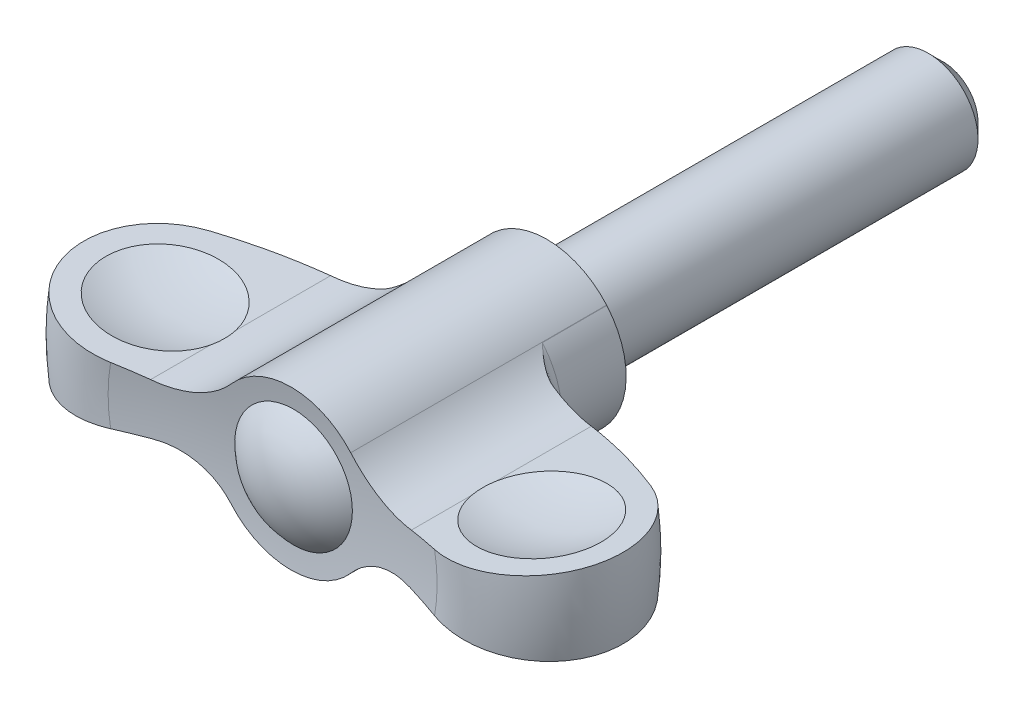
ISO-10303-21;
HEADER;
FILE_DESCRIPTION(('STEP AP214'),'2;1');
FILE_NAME('part.step','',(''),(''),'','','');
FILE_SCHEMA(('AUTOMOTIVE_DESIGN { 1 0 10303 214 1 1 1 1 }'));
ENDSEC;
DATA;
#1=APPLICATION_CONTEXT('core data for automotive mechanical design processes');
#2=APPLICATION_PROTOCOL_DEFINITION('international standard','automotive_design',2000,#1);
#3=PRODUCT_CONTEXT('',#1,'mechanical');
#4=PRODUCT('Part','Part','',(#3));
#5=PRODUCT_RELATED_PRODUCT_CATEGORY('part','',(#4));
#6=PRODUCT_DEFINITION_FORMATION('','',#4);
#7=PRODUCT_DEFINITION_CONTEXT('part definition',#1,'design');
#8=PRODUCT_DEFINITION('design','',#6,#7);
#9=PRODUCT_DEFINITION_SHAPE('','',#8);
#10=(LENGTH_UNIT() NAMED_UNIT(*) SI_UNIT(.MILLI.,.METRE.));
#11=(NAMED_UNIT(*) PLANE_ANGLE_UNIT() SI_UNIT($,.RADIAN.));
#12=(NAMED_UNIT(*) SI_UNIT($,.STERADIAN.) SOLID_ANGLE_UNIT());
#13=UNCERTAINTY_MEASURE_WITH_UNIT(LENGTH_MEASURE(1.E-05),#10,'distance_accuracy_value','');
#14=(GEOMETRIC_REPRESENTATION_CONTEXT(3) GLOBAL_UNCERTAINTY_ASSIGNED_CONTEXT((#13)) GLOBAL_UNIT_ASSIGNED_CONTEXT((#10,
#11,#12)) REPRESENTATION_CONTEXT('',''));
#15=CARTESIAN_POINT('',(0.,0.,0.));
#16=DIRECTION('',(0.,0.,1.));
#17=DIRECTION('',(1.,0.,0.));
#18=AXIS2_PLACEMENT_3D('',#15,#16,#17);
#19=CARTESIAN_POINT('',(0.,0.,6.5));
#20=DIRECTION('',(0.,0.,1.));
#21=DIRECTION('',(0.,-1.,0.));
#22=AXIS2_PLACEMENT_3D('',#19,#20,#21);
#23=TOROIDAL_SURFACE('',#22,9.4,1.40000000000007);
#24=DIRECTION('',(0.,0.,1.));
#25=VECTOR('',#24,1.);
#26=CARTESIAN_POINT('',(6.03890778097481,-5.2470556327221,-40.));
#27=LINE('',#26,#25);
#28=CARTESIAN_POINT('',(6.03890778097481,-5.24705563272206,6.5));
#29=VERTEX_POINT('',#28);
#30=CARTESIAN_POINT('',(6.03890778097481,-5.2470556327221,6.5021200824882));
#31=VERTEX_POINT('',#30);
#32=EDGE_CURVE('E178',#29,#31,#27,.T.);
#33=ORIENTED_EDGE('',*,*,#32,.F.);
#34=CARTESIAN_POINT('',(0.,0.,6.5));
#35=DIRECTION('',(0.,0.,1.));
#36=DIRECTION('',(0.,-1.,0.));
#37=AXIS2_PLACEMENT_3D('',#34,#35,#36);
#38=CIRCLE('',#37,8.);
#39=CARTESIAN_POINT('',(6.0470062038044,5.23772049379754,6.4999999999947));
#40=VERTEX_POINT('',#39);
#41=EDGE_CURVE('E299',#29,#40,#38,.T.);
#42=ORIENTED_EDGE('',*,*,#41,.T.);
#43=CARTESIAN_POINT('',(8.59708199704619,3.29504177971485,7.88661989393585));
#44=CARTESIAN_POINT('',(8.50944178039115,3.33729136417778,7.87729621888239));
#45=CARTESIAN_POINT('',(8.42307614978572,3.38091432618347,7.86348310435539));
#46=CARTESIAN_POINT('',(8.25334791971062,3.47048341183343,7.82827393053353));
#47=CARTESIAN_POINT('',(8.16997966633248,3.51642472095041,7.80689307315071));
#48=CARTESIAN_POINT('',(8.006927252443,3.6100455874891,7.75806975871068));
#49=CARTESIAN_POINT('',(7.92722117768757,3.65771052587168,7.73067131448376));
#50=CARTESIAN_POINT('',(7.77086822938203,3.75487699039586,7.67078020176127));
#51=CARTESIAN_POINT('',(7.69422278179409,3.80437935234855,7.6382851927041));
#52=CARTESIAN_POINT('',(7.51481068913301,3.9245724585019,7.55570149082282));
#53=CARTESIAN_POINT('',(7.41345025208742,3.996030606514,7.50367899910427));
#54=CARTESIAN_POINT('',(7.21620642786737,4.14190058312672,7.39355525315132));
#55=CARTESIAN_POINT('',(7.12032815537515,4.21631506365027,7.33544846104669));
#56=CARTESIAN_POINT('',(6.89765495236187,4.39723051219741,7.19147911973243));
#57=CARTESIAN_POINT('',(6.77323076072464,4.50501816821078,7.10356810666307));
#58=CARTESIAN_POINT('',(6.57394920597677,4.68848676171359,6.95337103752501));
#59=CARTESIAN_POINT('',(6.49659267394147,4.7626588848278,6.89250585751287));
#60=CARTESIAN_POINT('',(6.37240043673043,4.8865809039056,6.79132557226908));
#61=CARTESIAN_POINT('',(6.32451434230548,4.93561192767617,6.75141880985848));
#62=CARTESIAN_POINT('',(6.24744938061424,5.01656740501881,6.68590586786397));
#63=CARTESIAN_POINT('',(6.21784284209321,5.04817964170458,6.66041557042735));
#64=CARTESIAN_POINT('',(6.1701203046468,5.09997024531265,6.61881307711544));
#65=CARTESIAN_POINT('',(6.15183084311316,5.12002285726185,6.60274326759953));
#66=CARTESIAN_POINT('',(6.12231217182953,5.15271930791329,6.57655539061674));
#67=CARTESIAN_POINT('',(6.11100884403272,5.16531979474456,6.56646663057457));
#68=CARTESIAN_POINT('',(6.09275021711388,5.18580384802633,6.549990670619));
#69=CARTESIAN_POINT('',(6.08575717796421,5.19368060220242,6.54363714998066));
#70=CARTESIAN_POINT('',(6.07446460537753,5.20645064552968,6.53319636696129));
#71=CARTESIAN_POINT('',(6.07013806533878,5.21135545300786,6.52915239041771));
#72=CARTESIAN_POINT('',(6.06316395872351,5.21928103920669,6.52242537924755));
#73=CARTESIAN_POINT('',(6.06049083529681,5.22232358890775,6.51979601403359));
#74=CARTESIAN_POINT('',(6.05620285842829,5.22721145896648,6.51533355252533));
#75=CARTESIAN_POINT('',(6.05455913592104,5.22908696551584,6.51356171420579));
#76=CARTESIAN_POINT('',(6.05194270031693,5.23207504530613,6.51046552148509));
#77=CARTESIAN_POINT('',(6.05093886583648,5.23322217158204,6.50920550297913));
#78=CARTESIAN_POINT('',(6.04952852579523,5.23483466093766,6.50714224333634));
#79=CARTESIAN_POINT('',(6.04907130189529,5.23535757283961,6.50641962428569));
#80=CARTESIAN_POINT('',(6.04823146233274,5.23631829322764,6.50488003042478));
#81=CARTESIAN_POINT('',(6.04784824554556,5.23675678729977,6.50406390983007));
#82=CARTESIAN_POINT('',(6.04743475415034,5.2372299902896,6.50282878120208));
#83=CARTESIAN_POINT('',(6.04733123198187,5.23734847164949,6.50246832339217));
#84=CARTESIAN_POINT('',(6.04716301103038,5.23754100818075,6.50172769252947));
#85=CARTESIAN_POINT('',(6.04709815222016,5.23761524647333,6.50134760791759));
#86=CARTESIAN_POINT('',(6.04703697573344,5.23768527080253,6.50077037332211));
#87=CARTESIAN_POINT('',(6.04702259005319,5.23770173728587,6.50057747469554));
#88=CARTESIAN_POINT('',(6.0470060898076,5.23772062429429,6.50018965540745));
#89=CARTESIAN_POINT('',(6.04700402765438,5.23772298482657,6.49999472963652));
#90=CARTESIAN_POINT('',(6.0470084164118,5.23771796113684,6.49979999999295));
#91=B_SPLINE_CURVE_WITH_KNOTS('',3,(#43,#44,#45,#46,#47,#48,#49,#50,#51,#52,#53,#54,#55,#56,#57,
#58,#59,#60,#61,#62,#63,#64,#65,#66,#67,#68,#69,#70,#71,#72,#73,#74,#75,#76,#77,#78,#79,#80,#81,
#82,#83,#84,#85,#86,#87,#88,#89,#90),.UNSPECIFIED.,.F.,.F.,(4,2,2,2,2,2,2,2,2,2,2,2,2,2,2,2,2,2,
2,2,2,2,2,4),(0.,0.292919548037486,0.585253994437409,0.875517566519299,1.16591483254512,
1.56900991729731,1.97247513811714,2.53185645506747,2.90152662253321,3.1394263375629,
3.29018867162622,3.38481100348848,3.44392835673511,3.48083041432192,3.50389909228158,
3.51838177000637,3.52755772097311,3.53347737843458,3.53648190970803,3.53946090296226,
3.54063718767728,3.54180856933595,3.54239014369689,3.5429741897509),.UNSPECIFIED.);
#92=CARTESIAN_POINT('',(8.59520200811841,3.29594858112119,7.88641989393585));
#93=VERTEX_POINT('',#92);
#94=EDGE_CURVE('E445',#93,#40,#91,.T.);
#95=ORIENTED_EDGE('',*,*,#94,.F.);
#96=CARTESIAN_POINT('',(0.,0.,7.88641989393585));
#97=DIRECTION('',(0.,0.,1.));
#98=DIRECTION('',(0.,-1.,0.));
#99=AXIS2_PLACEMENT_3D('',#96,#97,#98);
#100=CIRCLE('',#99,9.20547525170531);
#101=CARTESIAN_POINT('',(8.59545916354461,-3.29527789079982,7.88641989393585));
#102=VERTEX_POINT('',#101);
#103=EDGE_CURVE('E300',#102,#93,#100,.T.);
#104=ORIENTED_EDGE('',*,*,#103,.F.);
#105=CARTESIAN_POINT('',(9.2464198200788,-3.01597169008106,7.86154869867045));
#106=CARTESIAN_POINT('',(9.191703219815,-3.03662617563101,7.87246212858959));
#107=CARTESIAN_POINT('',(9.13683292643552,-3.05803382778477,7.88088984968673));
#108=CARTESIAN_POINT('',(9.0272184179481,-3.10220967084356,7.89317258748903));
#109=CARTESIAN_POINT('',(8.97247413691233,-3.12497578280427,7.89703441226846));
#110=CARTESIAN_POINT('',(8.80995844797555,-3.19470660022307,7.90236716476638));
#111=CARTESIAN_POINT('',(8.70276195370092,-3.24353448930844,7.89779252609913));
#112=CARTESIAN_POINT('',(8.51047394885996,-3.33625869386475,7.87741400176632));
#113=CARTESIAN_POINT('',(8.42481297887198,-3.37951008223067,7.86372857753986));
#114=CARTESIAN_POINT('',(8.25627111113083,-3.46839491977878,7.82888132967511));
#115=CARTESIAN_POINT('',(8.17339149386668,-3.51402944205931,7.80771611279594));
#116=CARTESIAN_POINT('',(7.92832133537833,-3.65460006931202,7.73466741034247));
#117=CARTESIAN_POINT('',(7.77073045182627,-3.75270198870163,7.67337075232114));
#118=CARTESIAN_POINT('',(7.51219223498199,-3.92592329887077,7.55434149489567));
#119=CARTESIAN_POINT('',(7.40810830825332,-3.99942155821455,7.50076399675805));
#120=CARTESIAN_POINT('',(7.20573498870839,-4.14951628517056,7.38724676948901));
#121=CARTESIAN_POINT('',(7.10744753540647,-4.22611377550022,7.32730492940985));
#122=CARTESIAN_POINT('',(6.91648045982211,-4.38209339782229,7.20294133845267));
#123=CARTESIAN_POINT('',(6.82379096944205,-4.46147021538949,7.13852792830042));
#124=CARTESIAN_POINT('',(6.64338510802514,-4.62314447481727,7.00654560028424));
#125=CARTESIAN_POINT('',(6.55566785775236,-4.70544139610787,6.93897724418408));
#126=CARTESIAN_POINT('',(6.43300905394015,-4.82577735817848,6.84059313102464));
#127=CARTESIAN_POINT('',(6.39621820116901,-4.86258512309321,6.8105538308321));
#128=CARTESIAN_POINT('',(6.32347498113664,-4.93679114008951,6.75019039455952));
#129=CARTESIAN_POINT('',(6.28752259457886,-4.97418937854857,6.71986626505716));
#130=CARTESIAN_POINT('',(6.23420044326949,-5.03074553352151,6.67427938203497));
#131=CARTESIAN_POINT('',(6.21653276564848,-5.04966820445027,6.65907163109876));
#132=CARTESIAN_POINT('',(6.18141428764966,-5.08764734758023,6.62856921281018));
#133=CARTESIAN_POINT('',(6.16396349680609,-5.10670382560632,6.61327454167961));
#134=CARTESIAN_POINT('',(6.12918837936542,-5.14505447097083,6.58285648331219));
#135=CARTESIAN_POINT('',(6.11186402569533,-5.16434858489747,6.5677330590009));
#136=CARTESIAN_POINT('',(6.07769243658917,-5.20276831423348,6.53674407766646));
#137=CARTESIAN_POINT('',(6.06084502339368,-5.22189399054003,6.52087880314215));
#138=CARTESIAN_POINT('',(6.04125233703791,-5.24436286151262,6.50407138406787));
#139=CARTESIAN_POINT('',(6.03883132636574,-5.24714312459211,6.5020224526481));
#140=CARTESIAN_POINT('',(6.036402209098,-5.24993655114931,6.5));
#141=B_SPLINE_CURVE_WITH_KNOTS('',3,(#105,#106,#107,#108,#109,#110,#111,#112,#113,#114,#115,
#116,#117,#118,#119,#120,#121,#122,#123,#124,#125,#126,#127,#128,#129,#130,#131,#132,#133,#134,
#135,#136,#137,#138,#139,#140),.UNSPECIFIED.,.F.,.F.,(4,2,2,2,2,2,2,2,2,2,2,2,2,2,2,2,2,4),(0.,
0.178341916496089,0.356417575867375,0.708892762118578,0.999321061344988,1.28988128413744,
1.87442815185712,2.28884312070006,2.7033959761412,3.11719533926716,3.53092130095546,
3.71118323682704,3.89144102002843,3.98151493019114,4.07159278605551,4.16165075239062,
4.25167469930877,4.26432797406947),.UNSPECIFIED.);
#142=EDGE_CURVE('E316',#31,#102,#141,.F.);
#143=ORIENTED_EDGE('',*,*,#142,.F.);
#144=EDGE_LOOP('',(#33,#42,#95,#104,#143));
#145=FACE_BOUND('',#144,.T.);
#146=ADVANCED_FACE('F14',(#145),#23,.F.);
#147=CARTESIAN_POINT('',(7.9999999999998,0.,0.));
#148=DIRECTION('',(0.,0.,-1.));
#149=DIRECTION('',(0.,1.,0.));
#150=AXIS2_PLACEMENT_3D('',#147,#148,#149);
#151=PLANE('',#150);
#152=CARTESIAN_POINT('',(0.,0.,0.));
#153=DIRECTION('',(0.,0.,1.));
#154=DIRECTION('',(0.,-1.,0.));
#155=AXIS2_PLACEMENT_3D('',#152,#153,#154);
#156=CIRCLE('',#155,5.);
#157=CARTESIAN_POINT('',(0.,-5.,0.));
#158=VERTEX_POINT('',#157);
#159=EDGE_CURVE('E475',#158,#158,#156,.T.);
#160=ORIENTED_EDGE('',*,*,#159,.T.);
#161=EDGE_LOOP('',(#160));
#162=FACE_BOUND('',#161,.T.);
#163=CARTESIAN_POINT('',(12.0717114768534,10.5010774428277,0.));
#164=DIRECTION('',(0.,0.,-1.));
#165=DIRECTION('',(0.,1.,0.));
#166=AXIS2_PLACEMENT_3D('',#163,#164,#165);
#167=CIRCLE('',#166,8.);
#168=CARTESIAN_POINT('',(6.0470062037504,5.23772049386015,0.));
#169=VERTEX_POINT('',#168);
#170=CARTESIAN_POINT('',(6.02470527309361,5.26335694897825,0.));
#171=VERTEX_POINT('',#170);
#172=EDGE_CURVE('E454',#169,#171,#167,.T.);
#173=ORIENTED_EDGE('',*,*,#172,.F.);
#174=CARTESIAN_POINT('',(0.,0.,0.));
#175=DIRECTION('',(0.,0.,1.));
#176=DIRECTION('',(0.,-1.,0.));
#177=AXIS2_PLACEMENT_3D('',#174,#175,#176);
#178=CIRCLE('',#177,8.);
#179=CARTESIAN_POINT('',(-6.04700620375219,5.23772049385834,0.));
#180=VERTEX_POINT('',#179);
#181=EDGE_CURVE('E472',#180,#169,#178,.T.);
#182=ORIENTED_EDGE('',*,*,#181,.F.);
#183=CARTESIAN_POINT('',(-12.0717114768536,10.5010774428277,0.));
#184=DIRECTION('',(0.,0.,-1.));
#185=DIRECTION('',(0.,1.,0.));
#186=AXIS2_PLACEMENT_3D('',#183,#184,#185);
#187=CIRCLE('',#186,8.);
#188=CARTESIAN_POINT('',(-6.0247052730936,5.26335694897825,0.));
#189=VERTEX_POINT('',#188);
#190=EDGE_CURVE('E521',#180,#189,#187,.F.);
#191=ORIENTED_EDGE('',*,*,#190,.T.);
#192=EDGE_CURVE('E471',#171,#189,#178,.T.);
#193=ORIENTED_EDGE('',*,*,#192,.F.);
#194=EDGE_LOOP('',(#173,#182,#191,#193));
#195=FACE_BOUND('',#194,.T.);
#196=ADVANCED_FACE('F268',(#162,#195),#151,.T.);
#197=CARTESIAN_POINT('',(0.,0.,32.9780362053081));
#198=DIRECTION('',(0.,0.,1.));
#199=DIRECTION('',(0.,-1.,0.));
#200=AXIS2_PLACEMENT_3D('',#197,#198,#199);
#201=CYLINDRICAL_SURFACE('',#200,8.);
#202=DIRECTION('',(0.,0.,1.));
#203=VECTOR('',#202,1.);
#204=CARTESIAN_POINT('',(-6.0247052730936,5.26335694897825,-40.));
#205=LINE('',#204,#203);
#206=CARTESIAN_POINT('',(-6.0247052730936,5.26335694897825,25.8131362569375));
#207=VERTEX_POINT('',#206);
#208=EDGE_CURVE('E162',#189,#207,#205,.T.);
#209=ORIENTED_EDGE('',*,*,#208,.T.);
#210=CARTESIAN_POINT('',(0.,0.,25.8131362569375));
#211=DIRECTION('',(0.,0.,1.));
#212=DIRECTION('',(0.,-1.,0.));
#213=AXIS2_PLACEMENT_3D('',#210,#211,#212);
#214=CIRCLE('',#213,8.);
#215=CARTESIAN_POINT('',(6.02470527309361,5.26335694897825,25.8131362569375));
#216=VERTEX_POINT('',#215);
#217=EDGE_CURVE('E477',#216,#207,#214,.T.);
#218=ORIENTED_EDGE('',*,*,#217,.F.);
#219=DIRECTION('',(0.,0.,1.));
#220=VECTOR('',#219,1.);
#221=CARTESIAN_POINT('',(6.02470527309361,5.26335694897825,-40.));
#222=LINE('',#221,#220);
#223=EDGE_CURVE('E165',#171,#216,#222,.T.);
#224=ORIENTED_EDGE('',*,*,#223,.F.);
#225=ORIENTED_EDGE('',*,*,#192,.T.);
#226=EDGE_LOOP('',(#209,#218,#224,#225));
#227=FACE_BOUND('',#226,.T.);
#228=ADVANCED_FACE('F275',(#227),#201,.T.);
#229=DIRECTION('',(0.,0.,1.));
#230=VECTOR('',#229,1.);
#231=CARTESIAN_POINT('',(-6.04700620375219,5.23772049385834,3.25));
#232=LINE('',#231,#230);
#233=CARTESIAN_POINT('',(-6.04700620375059,5.23772049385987,6.5));
#234=VERTEX_POINT('',#233);
#235=EDGE_CURVE('E523',#180,#234,#232,.T.);
#236=ORIENTED_EDGE('',*,*,#235,.F.);
#237=ORIENTED_EDGE('',*,*,#181,.T.);
#238=DIRECTION('',(0.,0.,1.));
#239=VECTOR('',#238,1.);
#240=CARTESIAN_POINT('',(6.0470062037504,5.23772049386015,3.25));
#241=LINE('',#240,#239);
#242=EDGE_CURVE('E451',#169,#40,#241,.T.);
#243=ORIENTED_EDGE('',*,*,#242,.T.);
#244=ORIENTED_EDGE('',*,*,#41,.F.);
#245=ORIENTED_EDGE('',*,*,#32,.T.);
#246=CARTESIAN_POINT('',(6.03890778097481,-5.2470556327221,25.8131362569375));
#247=VERTEX_POINT('',#246);
#248=EDGE_CURVE('E175',#31,#247,#27,.T.);
#249=ORIENTED_EDGE('',*,*,#248,.T.);
#250=CARTESIAN_POINT('',(0.,0.,25.8131362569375));
#251=DIRECTION('',(0.,0.,1.));
#252=DIRECTION('',(0.,-1.,0.));
#253=AXIS2_PLACEMENT_3D('',#250,#251,#252);
#254=CIRCLE('',#253,8.);
#255=CARTESIAN_POINT('',(-6.0389077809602,-5.24705563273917,25.8131362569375));
#256=VERTEX_POINT('',#255);
#257=EDGE_CURVE('E304',#256,#247,#254,.T.);
#258=ORIENTED_EDGE('',*,*,#257,.F.);
#259=DIRECTION('',(0.,0.,1.));
#260=VECTOR('',#259,1.);
#261=CARTESIAN_POINT('',(-6.03890778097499,-5.2470556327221,-40.));
#262=LINE('',#261,#260);
#263=CARTESIAN_POINT('',(-6.03890778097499,-5.2470556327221,6.5021200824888));
#264=VERTEX_POINT('',#263);
#265=EDGE_CURVE('E171',#264,#256,#262,.T.);
#266=ORIENTED_EDGE('',*,*,#265,.F.);
#267=CARTESIAN_POINT('',(-6.03890778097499,-5.24705563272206,6.5));
#268=VERTEX_POINT('',#267);
#269=EDGE_CURVE('E174',#268,#264,#262,.T.);
#270=ORIENTED_EDGE('',*,*,#269,.F.);
#271=EDGE_CURVE('E294',#234,#268,#38,.T.);
#272=ORIENTED_EDGE('',*,*,#271,.F.);
#273=EDGE_LOOP('',(#236,#237,#243,#244,#245,#249,#258,#266,#270,#272));
#274=FACE_BOUND('',#273,.T.);
#275=ADVANCED_FACE('F282',(#274),#201,.T.);
#276=ORIENTED_EDGE('',*,*,#271,.T.);
#277=ORIENTED_EDGE('',*,*,#269,.T.);
#278=CARTESIAN_POINT('',(-9.246419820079,-3.01597169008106,7.86154869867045));
#279=CARTESIAN_POINT('',(-9.19170321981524,-3.03662617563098,7.87246212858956));
#280=CARTESIAN_POINT('',(-9.1368329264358,-3.05803382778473,7.88088984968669));
#281=CARTESIAN_POINT('',(-9.02721841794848,-3.10220967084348,7.89317258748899));
#282=CARTESIAN_POINT('',(-8.97247413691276,-3.12497578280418,7.89703441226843));
#283=CARTESIAN_POINT('',(-8.80995844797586,-3.19470660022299,7.9023671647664));
#284=CARTESIAN_POINT('',(-8.70276195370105,-3.24353448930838,7.89779252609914));
#285=CARTESIAN_POINT('',(-8.51047394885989,-3.33625869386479,7.87741400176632));
#286=CARTESIAN_POINT('',(-8.42481297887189,-3.37951008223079,7.86372857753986));
#287=CARTESIAN_POINT('',(-8.25627111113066,-3.46839491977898,7.82888132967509));
#288=CARTESIAN_POINT('',(-8.17339149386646,-3.51402944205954,7.80771611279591));
#289=CARTESIAN_POINT('',(-7.92832133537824,-3.65460006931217,7.73466741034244));
#290=CARTESIAN_POINT('',(-7.77073045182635,-3.75270198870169,7.67337075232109));
#291=CARTESIAN_POINT('',(-7.51219223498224,-3.92592329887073,7.55434149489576));
#292=CARTESIAN_POINT('',(-7.40810830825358,-3.99942155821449,7.50076399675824));
#293=CARTESIAN_POINT('',(-7.20573498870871,-4.14951628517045,7.38724676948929));
#294=CARTESIAN_POINT('',(-7.10744753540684,-4.22611377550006,7.32730492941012));
#295=CARTESIAN_POINT('',(-6.91648045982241,-4.38209339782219,7.20294133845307));
#296=CARTESIAN_POINT('',(-6.82379096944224,-4.46147021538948,7.13852792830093));
#297=CARTESIAN_POINT('',(-6.64338510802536,-4.62314447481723,7.00654560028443));
#298=CARTESIAN_POINT('',(-6.5556678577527,-4.7054413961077,6.93897724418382));
#299=CARTESIAN_POINT('',(-6.43300905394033,-4.82577735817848,6.84059313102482));
#300=CARTESIAN_POINT('',(-6.39621820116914,-4.86258512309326,6.81055383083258));
#301=CARTESIAN_POINT('',(-6.3234749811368,-4.93679114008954,6.75019039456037));
#302=CARTESIAN_POINT('',(-6.28752259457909,-4.97418937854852,6.71986626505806));
#303=CARTESIAN_POINT('',(-6.23420044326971,-5.03074553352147,6.6742793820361));
#304=CARTESIAN_POINT('',(-6.21653276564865,-5.04966820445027,6.65907163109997));
#305=CARTESIAN_POINT('',(-6.18141428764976,-5.08764734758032,6.62856921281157));
#306=CARTESIAN_POINT('',(-6.16396349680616,-5.10670382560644,6.61327454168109));
#307=CARTESIAN_POINT('',(-6.12918837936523,-5.14505447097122,6.58285648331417));
#308=CARTESIAN_POINT('',(-6.11186402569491,-5.1643485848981,6.56773305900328));
#309=CARTESIAN_POINT('',(-6.07769243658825,-5.20276831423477,6.53674407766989));
#310=CARTESIAN_POINT('',(-6.06084502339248,-5.22189399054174,6.52087880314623));
#311=CARTESIAN_POINT('',(-6.04125233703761,-5.24436286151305,6.50407138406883));
#312=CARTESIAN_POINT('',(-6.03883132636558,-5.24714312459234,6.50202245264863));
#313=CARTESIAN_POINT('',(-6.036402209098,-5.2499365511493,6.5));
#314=B_SPLINE_CURVE_WITH_KNOTS('',3,(#278,#279,#280,#281,#282,#283,#284,#285,#286,#287,#288,
#289,#290,#291,#292,#293,#294,#295,#296,#297,#298,#299,#300,#301,#302,#303,#304,#305,#306,#307,
#308,#309,#310,#311,#312,#313),.UNSPECIFIED.,.F.,.F.,(4,2,2,2,2,2,2,2,2,2,2,2,2,2,2,2,2,4),(0.,
0.178341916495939,0.356417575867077,0.708892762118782,0.999321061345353,1.28988128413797,
1.8744281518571,2.28884312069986,2.70339597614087,3.11719533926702,3.53092130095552,
3.71118323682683,3.89144102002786,3.98151493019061,4.07159278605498,4.16165075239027,
4.25167469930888,4.2643279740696),.UNSPECIFIED.);
#315=CARTESIAN_POINT('',(-8.59545916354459,-3.29527789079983,7.88641989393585));
#316=VERTEX_POINT('',#315);
#317=EDGE_CURVE('E311',#264,#316,#314,.F.);
#318=ORIENTED_EDGE('',*,*,#317,.T.);
#319=CARTESIAN_POINT('',(-8.5952020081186,3.29594858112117,7.88641989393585));
#320=VERTEX_POINT('',#319);
#321=EDGE_CURVE('E467',#320,#316,#100,.T.);
#322=ORIENTED_EDGE('',*,*,#321,.F.);
#323=CARTESIAN_POINT('',(-8.59708199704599,3.29504177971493,7.88661989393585));
#324=CARTESIAN_POINT('',(-8.50944178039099,3.33729136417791,7.87729621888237));
#325=CARTESIAN_POINT('',(-8.42307614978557,3.38091432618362,7.86348310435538));
#326=CARTESIAN_POINT('',(-8.25334791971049,3.47048341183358,7.82827393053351));
#327=CARTESIAN_POINT('',(-8.16997966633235,3.51642472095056,7.80689307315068));
#328=CARTESIAN_POINT('',(-8.00692725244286,3.61004558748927,7.75806975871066));
#329=CARTESIAN_POINT('',(-7.92722117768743,3.65771052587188,7.73067131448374));
#330=CARTESIAN_POINT('',(-7.77086822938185,3.75487699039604,7.67078020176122));
#331=CARTESIAN_POINT('',(-7.69422278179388,3.80437935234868,7.63828519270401));
#332=CARTESIAN_POINT('',(-7.51481068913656,3.92457245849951,7.55570149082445));
#333=CARTESIAN_POINT('',(-7.41345025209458,3.99603060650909,7.50367899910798));
#334=CARTESIAN_POINT('',(-7.21620642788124,4.14190058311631,7.39355525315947));
#335=CARTESIAN_POINT('',(-7.12032815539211,4.2163150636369,7.33544846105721));
#336=CARTESIAN_POINT('',(-6.8976549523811,4.39723051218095,7.19147911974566));
#337=CARTESIAN_POINT('',(-6.77323076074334,4.50501816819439,7.1035681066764));
#338=CARTESIAN_POINT('',(-6.57394920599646,4.68848676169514,6.95337103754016));
#339=CARTESIAN_POINT('',(-6.49659267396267,4.76265888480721,6.89250585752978));
#340=CARTESIAN_POINT('',(-6.37240043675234,4.88658090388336,6.7913255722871));
#341=CARTESIAN_POINT('',(-6.32451434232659,4.93561192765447,6.7514188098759));
#342=CARTESIAN_POINT('',(-6.24744938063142,5.01656740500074,6.68590586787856));
#343=CARTESIAN_POINT('',(-6.21784284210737,5.04817964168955,6.66041557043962));
#344=CARTESIAN_POINT('',(-6.17012030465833,5.09997024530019,6.61881307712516));
#345=CARTESIAN_POINT('',(-6.1518308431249,5.12002285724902,6.60274326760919));
#346=CARTESIAN_POINT('',(-6.12231217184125,5.15271930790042,6.57655539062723));
#347=CARTESIAN_POINT('',(-6.11100884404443,5.16531979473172,6.56646663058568));
#348=CARTESIAN_POINT('',(-6.09275021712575,5.1858038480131,6.54999067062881));
#349=CARTESIAN_POINT('',(-6.08575717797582,5.19368060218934,6.54363714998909));
#350=CARTESIAN_POINT('',(-6.07446460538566,5.20645064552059,6.53319636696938));
#351=CARTESIAN_POINT('',(-6.07013806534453,5.21135545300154,6.52915239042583));
#352=CARTESIAN_POINT('',(-6.06316395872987,5.21928103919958,6.52242537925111));
#353=CARTESIAN_POINT('',(-6.06049083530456,5.22232358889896,6.51979601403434));
#354=CARTESIAN_POINT('',(-6.05620285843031,5.22721145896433,6.51533355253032));
#355=CARTESIAN_POINT('',(-6.05455913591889,5.22908696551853,6.51356171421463));
#356=CARTESIAN_POINT('',(-6.05194270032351,5.23207504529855,6.51046552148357));
#357=CARTESIAN_POINT('',(-6.05093886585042,5.23322217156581,6.50920550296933));
#358=CARTESIAN_POINT('',(-6.04952852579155,5.23483466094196,6.5071422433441));
#359=CARTESIAN_POINT('',(-6.0490713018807,5.23535757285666,6.50641962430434));
#360=CARTESIAN_POINT('',(-6.04823146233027,5.23631829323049,6.50488003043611));
#361=CARTESIAN_POINT('',(-6.04784824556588,5.23675678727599,6.50406390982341));
#362=CARTESIAN_POINT('',(-6.04743475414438,5.23722999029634,6.50282878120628));
#363=CARTESIAN_POINT('',(-6.04733123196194,5.23734847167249,6.50246832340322));
#364=CARTESIAN_POINT('',(-6.04716301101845,5.23754100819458,6.50172769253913));
#365=CARTESIAN_POINT('',(-6.04709815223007,5.23761524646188,6.50134760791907));
#366=CARTESIAN_POINT('',(-6.04703697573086,5.23768527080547,6.5007703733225));
#367=CARTESIAN_POINT('',(-6.04702259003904,5.23770173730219,6.50057747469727));
#368=CARTESIAN_POINT('',(-6.04700608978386,5.23772062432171,6.50018965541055));
#369=CARTESIAN_POINT('',(-6.04700402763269,5.23772298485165,6.49999472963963));
#370=CARTESIAN_POINT('',(-6.0470084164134,5.23771796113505,6.49979999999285));
#371=B_SPLINE_CURVE_WITH_KNOTS('',3,(#323,#324,#325,#326,#327,#328,#329,#330,#331,#332,#333,
#334,#335,#336,#337,#338,#339,#340,#341,#342,#343,#344,#345,#346,#347,#348,#349,#350,#351,#352,
#353,#354,#355,#356,#357,#358,#359,#360,#361,#362,#363,#364,#365,#366,#367,#368,#369,#370),
.UNSPECIFIED.,.F.,.F.,(4,2,2,2,2,2,2,2,2,2,2,2,2,2,2,2,2,2,2,2,2,2,2,4),(0.,0.292919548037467,
0.58525399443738,0.875517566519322,1.16591483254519,1.56900991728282,1.97247513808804,
2.53185645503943,2.90152662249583,3.13942633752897,3.29018867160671,3.38481100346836,
3.44392835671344,3.48083041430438,3.503899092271,3.51838176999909,3.52755772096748,
3.53347737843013,3.53648190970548,3.53946090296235,3.54063718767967,3.54180856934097,
3.54239014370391,3.54297418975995),.UNSPECIFIED.);
#372=EDGE_CURVE('E194',#320,#234,#371,.T.);
#373=ORIENTED_EDGE('',*,*,#372,.T.);
#374=EDGE_LOOP('',(#276,#277,#318,#322,#373));
#375=FACE_BOUND('',#374,.T.);
#376=ADVANCED_FACE('F270',(#375),#23,.F.);
#377=CARTESIAN_POINT('',(0.,0.,55.408674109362));
#378=DIRECTION('',(0.,0.,1.));
#379=DIRECTION('',(0.,-1.,0.));
#380=AXIS2_PLACEMENT_3D('',#377,#378,#379);
#381=DEGENERATE_TOROIDAL_SURFACE('',#380,2.53775894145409,47.9877389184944,.T.);
#382=ORIENTED_EDGE('',*,*,#103,.T.);
#383=CARTESIAN_POINT('',(5.40789714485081,6.07461400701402,7.74825077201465));
#384=CARTESIAN_POINT('',(5.5291773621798,5.89198502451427,7.7417150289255));
#385=CARTESIAN_POINT('',(5.65803975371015,5.71432205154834,7.7372582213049));
#386=CARTESIAN_POINT('',(5.92992964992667,5.37014226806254,7.7324895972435));
#387=CARTESIAN_POINT('',(6.07295642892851,5.2036248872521,7.73217756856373));
#388=CARTESIAN_POINT('',(6.37210580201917,4.88302009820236,7.73568398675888));
#389=CARTESIAN_POINT('',(6.52822111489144,4.72892587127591,7.73950015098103));
#390=CARTESIAN_POINT('',(6.85248447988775,4.43414479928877,7.75130368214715));
#391=CARTESIAN_POINT('',(7.02063240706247,4.29345781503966,7.75929100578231));
#392=CARTESIAN_POINT('',(7.36839276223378,4.02596374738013,7.77954568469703));
#393=CARTESIAN_POINT('',(7.54804576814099,3.89921061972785,7.79182895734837));
#394=CARTESIAN_POINT('',(7.9169239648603,3.66105266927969,7.82074605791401));
#395=CARTESIAN_POINT('',(8.10614934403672,3.54964814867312,7.83737997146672));
#396=CARTESIAN_POINT('',(8.49266533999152,3.34297499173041,7.87504105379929));
#397=CARTESIAN_POINT('',(8.68995161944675,3.24769781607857,7.89606588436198));
#398=CARTESIAN_POINT('',(9.09122637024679,3.07379499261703,7.94252339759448));
#399=CARTESIAN_POINT('',(9.29521479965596,2.99516924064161,7.96795605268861));
#400=CARTESIAN_POINT('',(9.70845663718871,2.854990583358,8.02319155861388));
#401=CARTESIAN_POINT('',(9.91771139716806,2.79344211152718,8.05299554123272));
#402=CARTESIAN_POINT('',(10.3400150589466,2.68771529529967,8.11688005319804));
#403=CARTESIAN_POINT('',(10.5530655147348,2.64354424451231,8.15096237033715));
#404=CARTESIAN_POINT('',(10.9815499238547,2.57272696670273,8.22326754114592));
#405=CARTESIAN_POINT('',(11.1969857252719,2.54609545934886,8.2614938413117));
#406=CARTESIAN_POINT('',(11.6284903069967,2.51043256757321,8.34184151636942));
#407=CARTESIAN_POINT('',(11.844558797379,2.50139409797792,8.38396131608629));
#408=CARTESIAN_POINT('',(12.2806577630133,2.50077046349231,8.47281848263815));
#409=CARTESIAN_POINT('',(12.5006723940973,2.50956853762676,8.51963625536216));
#410=CARTESIAN_POINT('',(12.9384709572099,2.54513800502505,8.6167995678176));
#411=CARTESIAN_POINT('',(13.156254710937,2.57191082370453,8.66714538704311));
#412=CARTESIAN_POINT('',(13.5879515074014,2.6430363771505,8.77098851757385));
#413=CARTESIAN_POINT('',(13.8018678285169,2.68737341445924,8.82448297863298));
#414=CARTESIAN_POINT('',(14.2246542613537,2.79313397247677,8.93430204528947));
#415=CARTESIAN_POINT('',(14.4335251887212,2.85455471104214,8.99062618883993));
#416=CARTESIAN_POINT('',(14.6392212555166,2.92427775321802,9.04819298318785));
#417=B_SPLINE_CURVE_WITH_KNOTS('',3,(#383,#384,#385,#386,#387,#388,#389,#390,#391,#392,#393,
#394,#395,#396,#397,#398,#399,#400,#401,#402,#403,#404,#405,#406,#407,#408,#409,#410,#411,#412,
#413,#414,#415,#416),.UNSPECIFIED.,.F.,.F.,(4,2,2,2,2,2,2,2,2,2,2,2,2,2,2,2,4),(0.,
0.657784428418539,1.31553517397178,1.9729224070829,2.63030281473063,3.2901452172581,
3.95000060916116,4.60950551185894,5.26900628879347,5.92867812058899,6.58862653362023,
7.24912809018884,7.90936359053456,8.58393530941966,9.25856052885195,9.93258417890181,
10.6064981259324),.UNSPECIFIED.);
#418=CARTESIAN_POINT('',(13.1528156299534,2.57446317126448,8.66701618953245));
#419=VERTEX_POINT('',#418);
#420=EDGE_CURVE('E438',#93,#419,#417,.T.);
#421=ORIENTED_EDGE('',*,*,#420,.T.);
#422=CARTESIAN_POINT('',(13.1526156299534,2.57444288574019,8.66696966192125));
#423=CARTESIAN_POINT('',(13.9370340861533,2.65400458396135,8.84943351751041));
#424=CARTESIAN_POINT('',(14.7168563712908,2.73310010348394,9.05185397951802));
#425=CARTESIAN_POINT('',(16.2633623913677,2.88995853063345,9.49546553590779));
#426=CARTESIAN_POINT('',(17.0300745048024,2.96772431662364,9.73655668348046));
#427=CARTESIAN_POINT('',(18.5504261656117,3.12192996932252,10.2573018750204));
#428=CARTESIAN_POINT('',(19.3040656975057,3.19836983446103,10.5369559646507));
#429=CARTESIAN_POINT('',(20.7982632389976,3.34992273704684,11.134858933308));
#430=CARTESIAN_POINT('',(21.5387829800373,3.4250318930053,11.4532044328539));
#431=CARTESIAN_POINT('',(22.2708092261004,3.49927957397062,11.7901956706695));
#432=B_SPLINE_CURVE_WITH_KNOTS('',3,(#422,#423,#424,#425,#426,#427,#428,#429,#430,#431),
.UNSPECIFIED.,.F.,.F.,(4,2,2,2,4),(0.,2.42758220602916,4.84898838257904,7.27039742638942,
9.69798251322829),.UNSPECIFIED.);
#433=CARTESIAN_POINT('',(22.2703747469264,3.49923550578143,11.7899956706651));
#434=VERTEX_POINT('',#433);
#435=EDGE_CURVE('E431',#419,#434,#432,.T.);
#436=ORIENTED_EDGE('',*,*,#435,.T.);
#437=CARTESIAN_POINT('',(0.,0.,11.7899956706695));
#438=DIRECTION('',(0.,0.,1.));
#439=DIRECTION('',(0.,-1.,0.));
#440=AXIS2_PLACEMENT_3D('',#437,#438,#439);
#441=CIRCLE('',#440,22.5436075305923);
#442=CARTESIAN_POINT('',(22.2706216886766,-3.49766351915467,11.7899956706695));
#443=VERTEX_POINT('',#442);
#444=EDGE_CURVE('E464',#443,#434,#441,.T.);
#445=ORIENTED_EDGE('',*,*,#444,.F.);
#446=CARTESIAN_POINT('',(12.9962083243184,-2.55398166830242,8.63065853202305));
#447=CARTESIAN_POINT('',(13.7943446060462,-2.63519292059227,8.81347846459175));
#448=CARTESIAN_POINT('',(14.5877985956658,-2.71592774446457,9.01694513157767));
#449=CARTESIAN_POINT('',(16.1611919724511,-2.87602226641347,9.46398142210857));
#450=CARTESIAN_POINT('',(16.9411614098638,-2.95538502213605,9.70744418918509));
#451=CARTESIAN_POINT('',(18.4876557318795,-3.11274253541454,10.2342505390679));
#452=CARTESIAN_POINT('',(19.2541805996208,-3.19073729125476,10.5175941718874));
#453=CARTESIAN_POINT('',(20.7737763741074,-3.34535784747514,11.1241962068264));
#454=CARTESIAN_POINT('',(21.5268064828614,-3.42197949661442,11.4475578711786));
#455=CARTESIAN_POINT('',(22.271056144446,-3.4977077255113,11.7901956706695));
#456=B_SPLINE_CURVE_WITH_KNOTS('',3,(#446,#447,#448,#449,#450,#451,#452,#453,#454,#455),
.UNSPECIFIED.,.F.,.F.,(4,2,2,2,4),(0.,2.46819948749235,4.92990890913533,7.3916214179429,
9.85982400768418),.UNSPECIFIED.);
#457=CARTESIAN_POINT('',(12.9964083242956,-2.5540020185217,8.63070434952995));
#458=VERTEX_POINT('',#457);
#459=EDGE_CURVE('E414',#458,#443,#456,.T.);
#460=ORIENTED_EDGE('',*,*,#459,.F.);
#461=CARTESIAN_POINT('',(5.40816196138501,-6.0746786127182,7.7482771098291));
#462=CARTESIAN_POINT('',(5.52938177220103,-5.89205626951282,7.74173743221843));
#463=CARTESIAN_POINT('',(5.65818351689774,-5.7143974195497,7.73727619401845));
#464=CARTESIAN_POINT('',(5.92995209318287,-5.37022086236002,7.73249766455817));
#465=CARTESIAN_POINT('',(6.07291819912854,-5.20370258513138,7.7321801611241));
#466=CARTESIAN_POINT('',(6.37194671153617,-4.88309096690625,7.73567453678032));
#467=CARTESIAN_POINT('',(6.52800183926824,-4.72899081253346,7.73948413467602));
#468=CARTESIAN_POINT('',(6.85214571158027,-4.43419295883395,7.75127335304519));
#469=CARTESIAN_POINT('',(7.02023433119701,-4.29349512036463,7.75925293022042));
#470=CARTESIAN_POINT('',(7.36787685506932,-4.02597472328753,7.77949081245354));
#471=CARTESIAN_POINT('',(7.54747132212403,-3.89920607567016,7.79176502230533));
#472=CARTESIAN_POINT('',(7.91623418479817,-3.66101233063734,7.82066267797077));
#473=CARTESIAN_POINT('',(8.10540276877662,-3.54958753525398,7.83728620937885));
#474=CARTESIAN_POINT('',(8.49180737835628,-3.34286928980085,7.87492522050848));
#475=CARTESIAN_POINT('',(8.68903906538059,-3.24756730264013,7.89593836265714));
#476=CARTESIAN_POINT('',(9.09020720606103,-3.0736105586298,7.94237123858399));
#477=CARTESIAN_POINT('',(9.29414361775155,-2.99495569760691,7.96779094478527));
#478=CARTESIAN_POINT('',(9.70728411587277,-2.85471488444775,8.02299934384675));
#479=CARTESIAN_POINT('',(9.91648954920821,-2.79313334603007,8.05278916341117));
#480=CARTESIAN_POINT('',(10.3386977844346,-2.68733665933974,8.11664426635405));
#481=CARTESIAN_POINT('',(10.5517021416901,-2.6431288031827,8.15071133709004));
#482=CARTESIAN_POINT('',(10.980097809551,-2.57223450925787,8.22298504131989));
#483=CARTESIAN_POINT('',(11.1954909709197,-2.5455627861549,8.26119511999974));
#484=CARTESIAN_POINT('',(11.6269140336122,-2.50981645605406,8.34150952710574));
#485=CARTESIAN_POINT('',(11.8429436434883,-2.5007347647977,8.38361228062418));
#486=CARTESIAN_POINT('',(12.2789655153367,-2.50002106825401,8.4724337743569));
#487=CARTESIAN_POINT('',(12.4989420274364,-2.50877204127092,8.51923286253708));
#488=CARTESIAN_POINT('',(12.9366686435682,-2.5442445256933,8.61635812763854));
#489=CARTESIAN_POINT('',(13.1544185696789,-2.57096746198,8.66668458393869));
#490=CARTESIAN_POINT('',(13.5860522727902,-2.6419909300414,8.77048849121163));
#491=CARTESIAN_POINT('',(13.7999393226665,-2.68627577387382,8.82396309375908));
#492=CARTESIAN_POINT('',(14.2226717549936,-2.79192997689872,8.93374204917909));
#493=CARTESIAN_POINT('',(14.4315179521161,-2.85329655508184,8.99004594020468));
#494=CARTESIAN_POINT('',(14.6371915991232,-2.92296463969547,9.04759234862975));
#495=B_SPLINE_CURVE_WITH_KNOTS('',3,(#461,#462,#463,#464,#465,#466,#467,#468,#469,#470,#471,
#472,#473,#474,#475,#476,#477,#478,#479,#480,#481,#482,#483,#484,#485,#486,#487,#488,#489,#490,
#491,#492,#493,#494),.UNSPECIFIED.,.F.,.F.,(4,2,2,2,2,2,2,2,2,2,2,2,2,2,2,2,4),(0.,
0.657668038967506,1.31530240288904,1.97257345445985,2.62983768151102,3.28956225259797,
3.9492998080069,4.60868692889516,5.26806992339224,5.92762322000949,6.58745305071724,
7.24783584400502,7.90795261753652,8.58239553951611,9.25689194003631,9.93078716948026,
10.6045727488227),.UNSPECIFIED.);
#496=EDGE_CURVE('E314',#458,#102,#495,.F.);
#497=ORIENTED_EDGE('',*,*,#496,.T.);
#498=EDGE_LOOP('',(#382,#421,#436,#445,#460,#497));
#499=FACE_BOUND('',#498,.T.);
#500=ADVANCED_FACE('F281',(#499),#381,.T.);
#501=CARTESIAN_POINT('',(0.,0.,19.5161101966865));
#502=DIRECTION('',(0.,0.,1.));
#503=DIRECTION('',(0.,-1.,0.));
#504=AXIS2_PLACEMENT_3D('',#501,#502,#503);
#505=TOROIDAL_SURFACE('',#504,19.,8.5);
#506=CARTESIAN_POINT('',(0.,0.,27.6698599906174));
#507=DIRECTION('',(0.,0.,1.));
#508=DIRECTION('',(0.,-1.,0.));
#509=AXIS2_PLACEMENT_3D('',#506,#507,#508);
#510=CIRCLE('',#509,16.5986744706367);
#511=CARTESIAN_POINT('',(16.3443249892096,-2.89465625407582,27.6698599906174));
#512=VERTEX_POINT('',#511);
#513=CARTESIAN_POINT('',(16.3437132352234,2.89810832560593,27.6698599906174));
#514=VERTEX_POINT('',#513);
#515=EDGE_CURVE('E460',#512,#514,#510,.T.);
#516=ORIENTED_EDGE('',*,*,#515,.F.);
#517=CARTESIAN_POINT('',(22.2701871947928,-3.49761930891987,11.7897956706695));
#518=CARTESIAN_POINT('',(22.4865890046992,-3.51963843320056,11.8893708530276));
#519=CARTESIAN_POINT('',(22.6987916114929,-3.54123028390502,11.9981566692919));
#520=CARTESIAN_POINT('',(23.1133331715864,-3.5834103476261,12.2332797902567));
#521=CARTESIAN_POINT('',(23.3156725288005,-3.60399860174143,12.359616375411));
#522=CARTESIAN_POINT('',(23.7089103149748,-3.64401098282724,12.6288905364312));
#523=CARTESIAN_POINT('',(23.8998162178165,-3.66343587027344,12.771817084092));
#524=CARTESIAN_POINT('',(24.2689734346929,-3.70099802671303,13.0733193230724));
#525=CARTESIAN_POINT('',(24.4472249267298,-3.71913531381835,13.2318947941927));
#526=CARTESIAN_POINT('',(24.7898897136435,-3.75400183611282,13.5636589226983));
#527=CARTESIAN_POINT('',(24.9542960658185,-3.77073036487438,13.7368548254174));
#528=CARTESIAN_POINT('',(25.2679995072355,-3.80265003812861,14.0965647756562));
#529=CARTESIAN_POINT('',(25.4172963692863,-3.81784115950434,14.2830790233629));
#530=CARTESIAN_POINT('',(25.6996801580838,-3.84657402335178,14.6680564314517));
#531=CARTESIAN_POINT('',(25.8327705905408,-3.86011612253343,14.8665169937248));
#532=CARTESIAN_POINT('',(26.0818270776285,-3.88545789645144,15.2740114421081));
#533=CARTESIAN_POINT('',(26.1977932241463,-3.89725758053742,15.4830452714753));
#534=CARTESIAN_POINT('',(26.4116662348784,-3.91901939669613,15.9099873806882));
#535=CARTESIAN_POINT('',(26.5095909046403,-3.92898334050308,16.1278866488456));
#536=CARTESIAN_POINT('',(26.6868542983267,-3.9470200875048,16.5712819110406));
#537=CARTESIAN_POINT('',(26.7661865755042,-3.95509223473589,16.7967805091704));
#538=CARTESIAN_POINT('',(26.9056523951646,-3.96928303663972,17.2536913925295));
#539=CARTESIAN_POINT('',(26.9657864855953,-3.97540174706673,17.4851035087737));
#540=CARTESIAN_POINT('',(27.0664298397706,-3.98564232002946,17.9522037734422));
#541=CARTESIAN_POINT('',(27.1069388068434,-3.98976415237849,18.1878919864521));
#542=CARTESIAN_POINT('',(27.1680180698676,-3.99597903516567,18.6616856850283));
#543=CARTESIAN_POINT('',(27.1886032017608,-3.99807359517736,18.8997892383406));
#544=CARTESIAN_POINT('',(27.2097404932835,-4.00022433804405,19.3768982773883));
#545=CARTESIAN_POINT('',(27.2102922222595,-4.00028047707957,19.6159037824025));
#546=CARTESIAN_POINT('',(27.1913600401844,-3.99835410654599,20.0930519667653));
#547=CARTESIAN_POINT('',(27.1718811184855,-3.99637210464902,20.331194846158));
#548=CARTESIAN_POINT('',(27.1130241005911,-3.99038333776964,20.8050668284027));
#549=CARTESIAN_POINT('',(27.0736391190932,-3.98637587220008,21.0407950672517));
#550=CARTESIAN_POINT('',(26.9752654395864,-3.97636624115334,21.5079930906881));
#551=CARTESIAN_POINT('',(26.9162837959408,-3.97036479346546,21.739464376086));
#552=CARTESIAN_POINT('',(26.7791326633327,-3.95640951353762,22.1965957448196));
#553=CARTESIAN_POINT('',(26.7009627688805,-3.94845564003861,22.4222557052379));
#554=CARTESIAN_POINT('',(26.5259936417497,-3.93065233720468,22.8661561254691));
#555=CARTESIAN_POINT('',(26.4291944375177,-3.92080291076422,23.0843965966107));
#556=CARTESIAN_POINT('',(26.2176548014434,-3.89927851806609,23.5119136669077));
#557=CARTESIAN_POINT('',(26.1029139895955,-3.88760351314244,23.7211900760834));
#558=CARTESIAN_POINT('',(25.8562793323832,-3.86250816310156,24.129341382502));
#559=CARTESIAN_POINT('',(25.7243811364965,-3.84908737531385,24.328213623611));
#560=CARTESIAN_POINT('',(25.4443947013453,-3.82059844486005,24.7140892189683));
#561=CARTESIAN_POINT('',(25.2963064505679,-3.8055303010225,24.9010925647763));
#562=CARTESIAN_POINT('',(24.9849941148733,-3.77385392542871,25.2619068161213));
#563=CARTESIAN_POINT('',(24.8217699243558,-3.75724568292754,25.4357176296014));
#564=CARTESIAN_POINT('',(24.4813524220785,-3.72260782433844,25.7689123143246));
#565=CARTESIAN_POINT('',(24.3041593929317,-3.70457823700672,25.9282964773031));
#566=CARTESIAN_POINT('',(23.9369192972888,-3.6672111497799,26.2316340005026));
#567=CARTESIAN_POINT('',(23.746862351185,-3.64787264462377,26.3755752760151));
#568=CARTESIAN_POINT('',(23.3553745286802,-3.60803832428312,26.6468659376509));
#569=CARTESIAN_POINT('',(23.1539438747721,-3.58754253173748,26.7742156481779));
#570=CARTESIAN_POINT('',(22.7410978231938,-3.5455349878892,27.0114526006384));
#571=CARTESIAN_POINT('',(22.5296804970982,-3.52402304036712,27.1213364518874));
#572=CARTESIAN_POINT('',(22.0984744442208,-3.48014734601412,27.3228052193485));
#573=CARTESIAN_POINT('',(21.8786886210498,-3.45778389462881,27.4143964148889));
#574=CARTESIAN_POINT('',(21.431905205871,-3.41232318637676,27.5788085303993));
#575=CARTESIAN_POINT('',(21.20489740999,-3.38922489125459,27.6516014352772));
#576=CARTESIAN_POINT('',(20.7455990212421,-3.34249077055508,27.7777299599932));
#577=CARTESIAN_POINT('',(20.5133085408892,-3.31885495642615,27.8310659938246));
#578=CARTESIAN_POINT('',(20.0450990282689,-3.27121411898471,27.9179123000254));
#579=CARTESIAN_POINT('',(19.8091801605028,-3.24720911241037,27.9514234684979));
#580=CARTESIAN_POINT('',(19.3353786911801,-3.19899928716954,27.998395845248));
#581=CARTESIAN_POINT('',(19.0974961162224,-3.17479447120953,28.0118573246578));
#582=CARTESIAN_POINT('',(18.6210318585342,-3.12631370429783,28.0186515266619));
#583=CARTESIAN_POINT('',(18.3824496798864,-3.10203770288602,28.0119491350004));
#584=CARTESIAN_POINT('',(17.9067737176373,-3.05363714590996,27.9784021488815));
#585=CARTESIAN_POINT('',(17.6696794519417,-3.02951254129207,27.9515644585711));
#586=CARTESIAN_POINT('',(17.1984347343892,-2.98156286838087,27.8779318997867));
#587=CARTESIAN_POINT('',(16.9642861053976,-2.95773798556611,27.8311252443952));
#588=CARTESIAN_POINT('',(16.500740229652,-2.91057167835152,27.7178937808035));
#589=CARTESIAN_POINT('',(16.2713428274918,-2.88723023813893,27.6514696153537));
#590=CARTESIAN_POINT('',(15.8183308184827,-2.84113576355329,27.4992830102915));
#591=CARTESIAN_POINT('',(15.5947326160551,-2.81838439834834,27.4134712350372));
#592=CARTESIAN_POINT('',(15.155526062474,-2.77369464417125,27.2232203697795));
#593=CARTESIAN_POINT('',(14.9399175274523,-2.75175623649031,27.1187817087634));
#594=CARTESIAN_POINT('',(14.5185439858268,-2.70888101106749,26.8921972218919));
#595=CARTESIAN_POINT('',(14.3127646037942,-2.68794273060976,26.7700783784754));
#596=CARTESIAN_POINT('',(13.9122402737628,-2.64718893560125,26.5089238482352));
#597=CARTESIAN_POINT('',(13.7174893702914,-2.62737281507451,26.3698974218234));
#598=CARTESIAN_POINT('',(13.4370604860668,-2.59883886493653,26.1513001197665));
#599=CARTESIAN_POINT('',(13.3466503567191,-2.58963953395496,26.077788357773));
#600=CARTESIAN_POINT('',(13.1690334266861,-2.57156681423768,25.9272071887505));
#601=CARTESIAN_POINT('',(13.081822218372,-2.56269297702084,25.8501430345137));
#602=CARTESIAN_POINT('',(12.9962083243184,-2.55398166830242,25.7713054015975));
#603=B_SPLINE_CURVE_WITH_KNOTS('',3,(#517,#518,#519,#520,#521,#522,#523,#524,#525,#526,#527,
#528,#529,#530,#531,#532,#533,#534,#535,#536,#537,#538,#539,#540,#541,#542,#543,#544,#545,#546,
#547,#548,#549,#550,#551,#552,#553,#554,#555,#556,#557,#558,#559,#560,#561,#562,#563,#564,#565,
#566,#567,#568,#569,#570,#571,#572,#573,#574,#575,#576,#577,#578,#579,#580,#581,#582,#583,#584,
#585,#586,#587,#588,#589,#590,#591,#592,#593,#594,#595,#596,#597,#598,#599,#600,#601,#602),
.UNSPECIFIED.,.F.,.F.,(4,2,2,2,2,2,2,2,2,2,2,2,2,2,2,2,2,2,2,2,2,2,2,2,2,2,2,2,2,2,2,2,2,2,2,2,
2,2,2,2,2,2,4),(0.,0.71746500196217,1.4349005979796,2.15186197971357,2.86881327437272,
3.58612197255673,4.30344145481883,5.02060549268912,5.73776568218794,6.45421425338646,
7.17091088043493,7.88758704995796,8.60427405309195,9.32042697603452,10.0365952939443,
10.7525852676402,11.4688230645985,12.1848033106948,12.9007986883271,13.6167929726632,
14.3328024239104,15.0489937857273,15.7651856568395,16.481382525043,17.1975649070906,
17.9143037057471,18.6310284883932,19.3478922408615,20.0645094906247,20.7821886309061,
21.4998524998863,22.2174839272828,22.9351056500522,23.6539777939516,24.3726035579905,
25.0916540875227,25.8106810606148,26.5315587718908,27.2524198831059,27.9721922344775,
28.691572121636,29.0421492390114,29.3922236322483),.UNSPECIFIED.);
#604=EDGE_CURVE('E409',#443,#512,#603,.T.);
#605=ORIENTED_EDGE('',*,*,#604,.F.);
#606=ORIENTED_EDGE('',*,*,#444,.T.);
#607=CARTESIAN_POINT('',(22.269940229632,3.49919143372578,11.7897956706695));
#608=CARTESIAN_POINT('',(22.4863520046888,3.52114156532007,11.8893700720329));
#609=CARTESIAN_POINT('',(22.6985645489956,3.54266577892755,11.9981550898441));
#610=CARTESIAN_POINT('',(23.1131258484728,3.58471374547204,12.2332767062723));
#611=CARTESIAN_POINT('',(23.3154750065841,3.60523753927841,12.3596125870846));
#612=CARTESIAN_POINT('',(23.7087322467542,3.64512468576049,12.6288856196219));
#613=CARTESIAN_POINT('',(23.8996477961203,3.66448879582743,12.7718117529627));
#614=CARTESIAN_POINT('',(24.2688239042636,3.70193345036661,13.0733134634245));
#615=CARTESIAN_POINT('',(24.4470846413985,3.72001401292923,13.2318888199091));
#616=CARTESIAN_POINT('',(24.7897674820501,3.75477151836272,13.563653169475));
#617=CARTESIAN_POINT('',(24.9541826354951,3.77144775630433,13.7368494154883));
#618=CARTESIAN_POINT('',(25.267902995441,3.80326766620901,14.0965604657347));
#619=CARTESIAN_POINT('',(25.417207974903,3.81841131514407,14.2830754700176));
#620=CARTESIAN_POINT('',(25.6996071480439,3.84705439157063,14.6680547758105));
#621=CARTESIAN_POINT('',(25.8327048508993,3.86055417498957,14.8665164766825));
#622=CARTESIAN_POINT('',(26.081774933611,3.88581676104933,15.2740136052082));
#623=CARTESIAN_POINT('',(26.1977474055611,3.89757957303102,15.4830489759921));
#624=CARTESIAN_POINT('',(26.4116306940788,3.91927324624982,15.9099919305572));
#625=CARTESIAN_POINT('',(26.5095595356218,3.92920593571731,16.1278903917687));
#626=CARTESIAN_POINT('',(26.6868305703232,3.94718611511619,16.571284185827));
#627=CARTESIAN_POINT('',(26.7661663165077,3.95523295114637,16.7967821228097));
#628=CARTESIAN_POINT('',(26.9056383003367,3.9693792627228,17.2536918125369));
#629=CARTESIAN_POINT('',(26.9657750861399,3.97547879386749,17.4851033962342));
#630=CARTESIAN_POINT('',(27.0664230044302,3.98568727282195,17.9522026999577));
#631=CARTESIAN_POINT('',(27.1069338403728,3.98979619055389,18.1878904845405));
#632=CARTESIAN_POINT('',(27.1680156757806,3.99599157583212,18.6616810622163));
#633=CARTESIAN_POINT('',(27.1886017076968,3.99807956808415,18.8997818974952));
#634=CARTESIAN_POINT('',(27.2097403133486,4.00022360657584,19.376885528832));
#635=CARTESIAN_POINT('',(27.2102924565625,4.00027960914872,19.6158883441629));
#636=CARTESIAN_POINT('',(27.1913606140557,3.99835939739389,20.0930311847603));
#637=CARTESIAN_POINT('',(27.1718816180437,3.99638368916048,20.3311714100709));
#638=CARTESIAN_POINT('',(27.1130239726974,3.99041389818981,20.8050381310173));
#639=CARTESIAN_POINT('',(27.0736384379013,3.98641911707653,21.0407637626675));
#640=CARTESIAN_POINT('',(26.9752633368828,3.97644116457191,21.5079559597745));
#641=CARTESIAN_POINT('',(26.9162808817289,3.97045871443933,21.7394240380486));
#642=CARTESIAN_POINT('',(26.7791278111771,3.95654760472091,22.1965491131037));
#643=CARTESIAN_POINT('',(26.7009567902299,3.94861890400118,22.4222059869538));
#644=CARTESIAN_POINT('',(26.5259851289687,3.93087194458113,22.8661004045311));
#645=CARTESIAN_POINT('',(26.4291845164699,3.92105368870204,23.0843379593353));
#646=CARTESIAN_POINT('',(26.217641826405,3.89959741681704,23.5118494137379));
#647=CARTESIAN_POINT('',(26.1028993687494,3.88795936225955,23.7211231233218));
#648=CARTESIAN_POINT('',(25.8562607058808,3.86294338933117,24.1292701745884));
#649=CARTESIAN_POINT('',(25.7243600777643,3.84956502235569,24.3281408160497));
#650=CARTESIAN_POINT('',(25.4443684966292,3.82116614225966,24.7140134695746));
#651=CARTESIAN_POINT('',(25.2962775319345,3.80614562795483,24.9010154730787));
#652=CARTESIAN_POINT('',(24.9849596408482,3.77456939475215,25.26182725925));
#653=CARTESIAN_POINT('',(24.821732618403,3.75801366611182,25.4356369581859));
#654=CARTESIAN_POINT('',(24.4813092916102,3.72348533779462,25.768829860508));
#655=CARTESIAN_POINT('',(24.3041132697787,3.70551276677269,25.9282133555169));
#656=CARTESIAN_POINT('',(23.9368653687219,3.66826368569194,26.2315514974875));
#657=CARTESIAN_POINT('',(23.7468034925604,3.64898616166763,26.3754939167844));
#658=CARTESIAN_POINT('',(23.3553055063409,3.60927745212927,26.6467872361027));
#659=CARTESIAN_POINT('',(23.1538696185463,3.58884628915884,26.7741384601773));
#660=CARTESIAN_POINT('',(22.7410119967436,3.54697112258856,27.0113794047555));
#661=CARTESIAN_POINT('',(22.5295882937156,3.5255269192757,27.1212656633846));
#662=CARTESIAN_POINT('',(22.0983691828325,3.48178939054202,27.3227397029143));
#663=CARTESIAN_POINT('',(21.8785766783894,3.45949635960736,27.414333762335));
#664=CARTESIAN_POINT('',(21.4317737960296,3.41417820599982,27.5787543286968));
#665=CARTESIAN_POINT('',(21.2047530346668,3.3911520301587,27.6515523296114));
#666=CARTESIAN_POINT('',(20.7454281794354,3.34456380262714,27.7776907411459));
#667=CARTESIAN_POINT('',(20.5131241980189,3.32100176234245,27.8310315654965));
#668=CARTESIAN_POINT('',(20.0448917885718,3.273510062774,27.9178864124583));
#669=CARTESIAN_POINT('',(19.808963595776,3.24958042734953,27.9514017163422));
#670=CARTESIAN_POINT('',(19.33514312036,3.20152194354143,27.9983830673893));
#671=CARTESIAN_POINT('',(19.09725086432,3.17739309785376,28.0118493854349));
#672=CARTESIAN_POINT('',(18.6207682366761,3.1290645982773,28.0186540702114));
#673=CARTESIAN_POINT('',(18.3821773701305,3.10486489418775,28.0119574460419));
#674=CARTESIAN_POINT('',(17.906483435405,3.05661638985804,27.9784231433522));
#675=CARTESIAN_POINT('',(17.6693798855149,3.03256754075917,27.951592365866));
#676=CARTESIAN_POINT('',(17.1980962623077,2.98476636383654,27.8779717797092));
#677=CARTESIAN_POINT('',(16.9639182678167,2.96101424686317,27.831168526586));
#678=CARTESIAN_POINT('',(16.5003145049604,2.91399201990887,27.7179420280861));
#679=CARTESIAN_POINT('',(16.2708885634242,2.89072189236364,27.6515194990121));
#680=CARTESIAN_POINT('',(15.8177881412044,2.84476499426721,27.4993238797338));
#681=CARTESIAN_POINT('',(15.594130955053,2.8220799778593,27.4134987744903));
#682=CARTESIAN_POINT('',(15.1548092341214,2.77752062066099,27.2232142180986));
#683=CARTESIAN_POINT('',(14.9391444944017,2.75564625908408,27.118755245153));
#684=CARTESIAN_POINT('',(14.5177209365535,2.71290226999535,26.892155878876));
#685=CARTESIAN_POINT('',(14.3119451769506,2.69203092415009,26.7700472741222));
#686=CARTESIAN_POINT('',(13.9114301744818,2.6514076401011,26.508917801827));
#687=CARTESIAN_POINT('',(13.7166843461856,2.63165503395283,26.3699071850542));
#688=CARTESIAN_POINT('',(13.4640710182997,2.60603306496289,26.1730131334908));
#689=CARTESIAN_POINT('',(13.4007037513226,2.59960587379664,26.1221461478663));
#690=CARTESIAN_POINT('',(13.2755127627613,2.58690804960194,26.0186683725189));
#691=CARTESIAN_POINT('',(13.2136874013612,2.58063725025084,25.9660595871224));
#692=CARTESIAN_POINT('',(13.1526156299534,2.57444288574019,25.9125680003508));
#693=B_SPLINE_CURVE_WITH_KNOTS('',3,(#607,#608,#609,#610,#611,#612,#613,#614,#615,#616,#617,
#618,#619,#620,#621,#622,#623,#624,#625,#626,#627,#628,#629,#630,#631,#632,#633,#634,#635,#636,
#637,#638,#639,#640,#641,#642,#643,#644,#645,#646,#647,#648,#649,#650,#651,#652,#653,#654,#655,
#656,#657,#658,#659,#660,#661,#662,#663,#664,#665,#666,#667,#668,#669,#670,#671,#672,#673,#674,
#675,#676,#677,#678,#679,#680,#681,#682,#683,#684,#685,#686,#687,#688,#689,#690,#691,#692),
.UNSPECIFIED.,.F.,.F.,(4,2,2,2,2,2,2,2,2,2,2,2,2,2,2,2,2,2,2,2,2,2,2,2,2,2,2,2,2,2,2,2,2,2,2,2,
2,2,2,2,2,2,4),(0.,0.717472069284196,1.43491480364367,2.15188374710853,2.8688425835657,
3.58615919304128,4.30348657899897,5.02065837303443,5.73782631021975,6.45427388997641,
7.17096952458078,7.88764469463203,8.60433069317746,9.3204755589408,10.0366358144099,
10.7526177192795,11.468847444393,12.1848175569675,12.9008028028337,13.6167869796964,
14.3327863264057,15.0489706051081,15.7651554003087,16.4813447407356,17.197519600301,
17.914257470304,18.6309813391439,19.3478470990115,20.0644663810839,20.7821661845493,
21.4998507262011,22.2174888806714,22.9351173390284,23.6539918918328,24.3726201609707,
25.0917329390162,25.8108194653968,26.5318570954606,27.2528762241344,27.9726125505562,
28.6919145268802,28.936425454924,29.1806641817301),.UNSPECIFIED.);
#694=EDGE_CURVE('E425',#434,#514,#693,.T.);
#695=ORIENTED_EDGE('',*,*,#694,.T.);
#696=EDGE_LOOP('',(#516,#605,#606,#695));
#697=FACE_BOUND('',#696,.T.);
#698=ADVANCED_FACE('F289',(#697),#505,.T.);
#699=CARTESIAN_POINT('',(-16.3437132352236,2.89810832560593,27.6698599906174));
#700=VERTEX_POINT('',#699);
#701=CARTESIAN_POINT('',(-16.3443249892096,-2.89465625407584,27.6698599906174));
#702=VERTEX_POINT('',#701);
#703=EDGE_CURVE('E459',#700,#702,#510,.T.);
#704=ORIENTED_EDGE('',*,*,#703,.F.);
#705=CARTESIAN_POINT('',(-22.269940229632,3.49919143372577,11.7897956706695));
#706=CARTESIAN_POINT('',(-22.4863520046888,3.52114156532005,11.8893700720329));
#707=CARTESIAN_POINT('',(-22.6985645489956,3.54266577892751,11.9981550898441));
#708=CARTESIAN_POINT('',(-23.1131258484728,3.584713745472,12.2332767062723));
#709=CARTESIAN_POINT('',(-23.3154750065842,3.60523753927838,12.3596125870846));
#710=CARTESIAN_POINT('',(-23.7087322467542,3.64512468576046,12.628885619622));
#711=CARTESIAN_POINT('',(-23.8996477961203,3.6644887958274,12.7718117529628));
#712=CARTESIAN_POINT('',(-24.2688239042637,3.70193345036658,13.0733134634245));
#713=CARTESIAN_POINT('',(-24.4470846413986,3.72001401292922,13.2318888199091));
#714=CARTESIAN_POINT('',(-24.7897674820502,3.7547715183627,13.5636531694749));
#715=CARTESIAN_POINT('',(-24.9541826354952,3.7714477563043,13.7368494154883));
#716=CARTESIAN_POINT('',(-25.267902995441,3.80326766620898,14.0965604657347));
#717=CARTESIAN_POINT('',(-25.4172079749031,3.81841131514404,14.2830754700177));
#718=CARTESIAN_POINT('',(-25.6996071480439,3.8470543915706,14.6680547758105));
#719=CARTESIAN_POINT('',(-25.8327048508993,3.86055417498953,14.8665164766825));
#720=CARTESIAN_POINT('',(-26.081774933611,3.88581676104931,15.2740136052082));
#721=CARTESIAN_POINT('',(-26.1977474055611,3.89757957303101,15.4830489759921));
#722=CARTESIAN_POINT('',(-26.4116306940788,3.9192732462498,15.9099919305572));
#723=CARTESIAN_POINT('',(-26.5095595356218,3.92920593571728,16.1278903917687));
#724=CARTESIAN_POINT('',(-26.6868305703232,3.94718611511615,16.571284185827));
#725=CARTESIAN_POINT('',(-26.7661663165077,3.95523295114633,16.7967821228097));
#726=CARTESIAN_POINT('',(-26.9056383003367,3.96937926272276,17.2536918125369));
#727=CARTESIAN_POINT('',(-26.9657750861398,3.97547879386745,17.4851033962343));
#728=CARTESIAN_POINT('',(-27.0664230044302,3.98568727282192,17.9522026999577));
#729=CARTESIAN_POINT('',(-27.1069338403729,3.98979619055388,18.1878904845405));
#730=CARTESIAN_POINT('',(-27.1680156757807,3.99599157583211,18.6616810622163));
#731=CARTESIAN_POINT('',(-27.1886017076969,3.99807956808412,18.8997818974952));
#732=CARTESIAN_POINT('',(-27.2097403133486,4.0002236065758,19.3768855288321));
#733=CARTESIAN_POINT('',(-27.2102924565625,4.00027960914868,19.6158883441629));
#734=CARTESIAN_POINT('',(-27.1913606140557,3.99835939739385,20.0930311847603));
#735=CARTESIAN_POINT('',(-27.1718816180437,3.99638368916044,20.331171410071));
#736=CARTESIAN_POINT('',(-27.1130239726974,3.99041389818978,20.8050381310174));
#737=CARTESIAN_POINT('',(-27.0736384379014,3.98641911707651,21.0407637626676));
#738=CARTESIAN_POINT('',(-26.9752633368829,3.97644116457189,21.5079559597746));
#739=CARTESIAN_POINT('',(-26.9162808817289,3.9704587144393,21.7394240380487));
#740=CARTESIAN_POINT('',(-26.779127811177,3.95654760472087,22.1965491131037));
#741=CARTESIAN_POINT('',(-26.7009567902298,3.94861890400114,22.4222059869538));
#742=CARTESIAN_POINT('',(-26.5259851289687,3.93087194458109,22.8661004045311));
#743=CARTESIAN_POINT('',(-26.4291845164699,3.921053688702,23.0843379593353));
#744=CARTESIAN_POINT('',(-26.217641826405,3.89959741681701,23.5118494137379));
#745=CARTESIAN_POINT('',(-26.1028993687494,3.88795936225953,23.7211231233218));
#746=CARTESIAN_POINT('',(-25.8562607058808,3.86294338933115,24.1292701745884));
#747=CARTESIAN_POINT('',(-25.7243600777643,3.84956502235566,24.3281408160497));
#748=CARTESIAN_POINT('',(-25.4443684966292,3.82116614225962,24.7140134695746));
#749=CARTESIAN_POINT('',(-25.2962775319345,3.80614562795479,24.9010154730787));
#750=CARTESIAN_POINT('',(-24.9849596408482,3.77456939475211,25.26182725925));
#751=CARTESIAN_POINT('',(-24.8217326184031,3.75801366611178,25.4356369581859));
#752=CARTESIAN_POINT('',(-24.4813092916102,3.72348533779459,25.768829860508));
#753=CARTESIAN_POINT('',(-24.3041132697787,3.70551276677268,25.9282133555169));
#754=CARTESIAN_POINT('',(-23.9368653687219,3.66826368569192,26.2315514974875));
#755=CARTESIAN_POINT('',(-23.7468034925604,3.6489861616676,26.3754939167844));
#756=CARTESIAN_POINT('',(-23.355305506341,3.60927745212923,26.6467872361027));
#757=CARTESIAN_POINT('',(-23.1538696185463,3.58884628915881,26.7741384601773));
#758=CARTESIAN_POINT('',(-22.7410119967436,3.54697112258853,27.0113794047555));
#759=CARTESIAN_POINT('',(-22.5295882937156,3.52552691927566,27.1212656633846));
#760=CARTESIAN_POINT('',(-22.0983691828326,3.48178939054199,27.3227397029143));
#761=CARTESIAN_POINT('',(-21.8785766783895,3.45949635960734,27.414333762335));
#762=CARTESIAN_POINT('',(-21.4317737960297,3.4141782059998,27.5787543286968));
#763=CARTESIAN_POINT('',(-21.2047530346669,3.39115203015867,27.6515523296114));
#764=CARTESIAN_POINT('',(-20.7454281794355,3.34456380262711,27.7776907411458));
#765=CARTESIAN_POINT('',(-20.513124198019,3.32100176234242,27.8310315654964));
#766=CARTESIAN_POINT('',(-20.0448917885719,3.27351006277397,27.9178864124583));
#767=CARTESIAN_POINT('',(-19.808963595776,3.2495804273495,27.9514017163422));
#768=CARTESIAN_POINT('',(-19.33514312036,3.20152194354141,27.9983830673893));
#769=CARTESIAN_POINT('',(-19.09725086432,3.17739309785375,28.0118493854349));
#770=CARTESIAN_POINT('',(-18.6207682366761,3.12906459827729,28.0186540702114));
#771=CARTESIAN_POINT('',(-18.3821773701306,3.10486489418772,28.0119574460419));
#772=CARTESIAN_POINT('',(-17.906483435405,3.056616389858,27.9784231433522));
#773=CARTESIAN_POINT('',(-17.669379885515,3.03256754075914,27.951592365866));
#774=CARTESIAN_POINT('',(-17.1980962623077,2.9847663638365,27.8779717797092));
#775=CARTESIAN_POINT('',(-16.9639182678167,2.96101424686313,27.831168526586));
#776=CARTESIAN_POINT('',(-16.5003145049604,2.91399201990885,27.7179420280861));
#777=CARTESIAN_POINT('',(-16.2708885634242,2.89072189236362,27.6515194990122));
#778=CARTESIAN_POINT('',(-15.8177881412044,2.8447649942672,27.4993238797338));
#779=CARTESIAN_POINT('',(-15.594130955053,2.82207997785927,27.4134987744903));
#780=CARTESIAN_POINT('',(-15.1548092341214,2.77752062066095,27.2232142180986));
#781=CARTESIAN_POINT('',(-14.9391444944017,2.75564625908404,27.118755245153));
#782=CARTESIAN_POINT('',(-14.5177209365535,2.71290226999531,26.892155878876));
#783=CARTESIAN_POINT('',(-14.3119451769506,2.69203092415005,26.7700472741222));
#784=CARTESIAN_POINT('',(-13.9114301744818,2.65140764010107,26.508917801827));
#785=CARTESIAN_POINT('',(-13.7166843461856,2.63165503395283,26.3699071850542));
#786=CARTESIAN_POINT('',(-13.4640710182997,2.60603306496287,26.1730131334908));
#787=CARTESIAN_POINT('',(-13.4007037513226,2.59960587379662,26.1221461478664));
#788=CARTESIAN_POINT('',(-13.2755127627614,2.58690804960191,26.0186683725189));
#789=CARTESIAN_POINT('',(-13.2136874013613,2.58063725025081,25.9660595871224));
#790=CARTESIAN_POINT('',(-13.1526156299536,2.57444288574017,25.9125680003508));
#791=B_SPLINE_CURVE_WITH_KNOTS('',3,(#705,#706,#707,#708,#709,#710,#711,#712,#713,#714,#715,
#716,#717,#718,#719,#720,#721,#722,#723,#724,#725,#726,#727,#728,#729,#730,#731,#732,#733,#734,
#735,#736,#737,#738,#739,#740,#741,#742,#743,#744,#745,#746,#747,#748,#749,#750,#751,#752,#753,
#754,#755,#756,#757,#758,#759,#760,#761,#762,#763,#764,#765,#766,#767,#768,#769,#770,#771,#772,
#773,#774,#775,#776,#777,#778,#779,#780,#781,#782,#783,#784,#785,#786,#787,#788,#789,#790),
.UNSPECIFIED.,.F.,.F.,(4,2,2,2,2,2,2,2,2,2,2,2,2,2,2,2,2,2,2,2,2,2,2,2,2,2,2,2,2,2,2,2,2,2,2,2,
2,2,2,2,2,2,4),(0.,0.717472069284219,1.43491480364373,2.1518837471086,2.86884258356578,
3.58615919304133,4.30348657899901,5.02065837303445,5.73782631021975,6.45427388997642,
7.1709695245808,7.88764469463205,8.60433069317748,9.32047555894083,10.0366358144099,
10.7526177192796,11.4688474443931,12.1848175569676,12.9008028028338,13.6167869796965,
14.3327863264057,15.0489706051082,15.7651554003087,16.4813447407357,17.197519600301,
17.914257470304,18.6309813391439,19.3478470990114,20.0644663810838,20.7821661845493,
21.4998507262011,22.2174888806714,22.9351173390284,23.6539918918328,24.3726201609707,
25.0917329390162,25.8108194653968,26.5318570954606,27.2528762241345,27.9726125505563,
28.6919145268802,28.9364254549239,29.18066418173),.UNSPECIFIED.);
#792=CARTESIAN_POINT('',(-22.2703747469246,3.49923550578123,11.7899956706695));
#793=VERTEX_POINT('',#792);
#794=EDGE_CURVE('E498',#793,#700,#791,.T.);
#795=ORIENTED_EDGE('',*,*,#794,.F.);
#796=CARTESIAN_POINT('',(-22.2706216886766,-3.49766351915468,11.7899956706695));
#797=VERTEX_POINT('',#796);
#798=EDGE_CURVE('E463',#793,#797,#441,.T.);
#799=ORIENTED_EDGE('',*,*,#798,.T.);
#800=CARTESIAN_POINT('',(-22.2701871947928,-3.49761930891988,11.7897956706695));
#801=CARTESIAN_POINT('',(-22.4865890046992,-3.51963843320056,11.8893708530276));
#802=CARTESIAN_POINT('',(-22.6987916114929,-3.54123028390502,11.9981566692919));
#803=CARTESIAN_POINT('',(-23.1133331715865,-3.5834103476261,12.2332797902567));
#804=CARTESIAN_POINT('',(-23.3156725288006,-3.60399860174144,12.359616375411));
#805=CARTESIAN_POINT('',(-23.7089103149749,-3.64401098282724,12.6288905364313));
#806=CARTESIAN_POINT('',(-23.8998162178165,-3.66343587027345,12.7718170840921));
#807=CARTESIAN_POINT('',(-24.268973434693,-3.70099802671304,13.0733193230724));
#808=CARTESIAN_POINT('',(-24.4472249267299,-3.71913531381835,13.2318947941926));
#809=CARTESIAN_POINT('',(-24.7898897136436,-3.75400183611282,13.5636589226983));
#810=CARTESIAN_POINT('',(-24.9542960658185,-3.77073036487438,13.7368548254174));
#811=CARTESIAN_POINT('',(-25.2679995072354,-3.80265003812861,14.0965647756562));
#812=CARTESIAN_POINT('',(-25.4172963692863,-3.81784115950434,14.2830790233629));
#813=CARTESIAN_POINT('',(-25.6996801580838,-3.84657402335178,14.6680564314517));
#814=CARTESIAN_POINT('',(-25.8327705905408,-3.86011612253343,14.8665169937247));
#815=CARTESIAN_POINT('',(-26.0818270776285,-3.88545789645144,15.2740114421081));
#816=CARTESIAN_POINT('',(-26.1977932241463,-3.89725758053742,15.4830452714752));
#817=CARTESIAN_POINT('',(-26.4116662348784,-3.91901939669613,15.9099873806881));
#818=CARTESIAN_POINT('',(-26.5095909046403,-3.92898334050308,16.1278866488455));
#819=CARTESIAN_POINT('',(-26.6868542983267,-3.94702008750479,16.5712819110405));
#820=CARTESIAN_POINT('',(-26.7661865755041,-3.95509223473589,16.7967805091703));
#821=CARTESIAN_POINT('',(-26.9056523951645,-3.96928303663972,17.2536913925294));
#822=CARTESIAN_POINT('',(-26.9657864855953,-3.97540174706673,17.4851035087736));
#823=CARTESIAN_POINT('',(-27.0664298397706,-3.98564232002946,17.9522037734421));
#824=CARTESIAN_POINT('',(-27.1069388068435,-3.98976415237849,18.187891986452));
#825=CARTESIAN_POINT('',(-27.1680180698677,-3.99597903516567,18.6616856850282));
#826=CARTESIAN_POINT('',(-27.1886032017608,-3.99807359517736,18.8997892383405));
#827=CARTESIAN_POINT('',(-27.2097404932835,-4.00022433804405,19.3768982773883));
#828=CARTESIAN_POINT('',(-27.2102922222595,-4.00028047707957,19.6159037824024));
#829=CARTESIAN_POINT('',(-27.1913600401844,-3.99835410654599,20.0930519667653));
#830=CARTESIAN_POINT('',(-27.1718811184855,-3.99637210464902,20.331194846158));
#831=CARTESIAN_POINT('',(-27.1130241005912,-3.99038333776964,20.8050668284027));
#832=CARTESIAN_POINT('',(-27.0736391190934,-3.98637587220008,21.0407950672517));
#833=CARTESIAN_POINT('',(-26.9752654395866,-3.97636624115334,21.5079930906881));
#834=CARTESIAN_POINT('',(-26.9162837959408,-3.97036479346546,21.739464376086));
#835=CARTESIAN_POINT('',(-26.7791326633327,-3.95640951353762,22.1965957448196));
#836=CARTESIAN_POINT('',(-26.7009627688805,-3.94845564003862,22.4222557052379));
#837=CARTESIAN_POINT('',(-26.5259936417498,-3.93065233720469,22.8661561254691));
#838=CARTESIAN_POINT('',(-26.4291944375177,-3.92080291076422,23.0843965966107));
#839=CARTESIAN_POINT('',(-26.2176548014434,-3.89927851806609,23.5119136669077));
#840=CARTESIAN_POINT('',(-26.1029139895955,-3.88760351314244,23.7211900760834));
#841=CARTESIAN_POINT('',(-25.8562793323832,-3.86250816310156,24.129341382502));
#842=CARTESIAN_POINT('',(-25.7243811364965,-3.84908737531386,24.328213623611));
#843=CARTESIAN_POINT('',(-25.4443947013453,-3.82059844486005,24.7140892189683));
#844=CARTESIAN_POINT('',(-25.2963064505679,-3.80553030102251,24.9010925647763));
#845=CARTESIAN_POINT('',(-24.9849941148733,-3.77385392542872,25.2619068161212));
#846=CARTESIAN_POINT('',(-24.8217699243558,-3.75724568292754,25.4357176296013));
#847=CARTESIAN_POINT('',(-24.4813524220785,-3.72260782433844,25.7689123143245));
#848=CARTESIAN_POINT('',(-24.3041593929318,-3.70457823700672,25.9282964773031));
#849=CARTESIAN_POINT('',(-23.9369192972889,-3.66721114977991,26.2316340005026));
#850=CARTESIAN_POINT('',(-23.746862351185,-3.64787264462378,26.375575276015));
#851=CARTESIAN_POINT('',(-23.3553745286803,-3.60803832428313,26.6468659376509));
#852=CARTESIAN_POINT('',(-23.1539438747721,-3.58754253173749,26.7742156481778));
#853=CARTESIAN_POINT('',(-22.7410978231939,-3.54553498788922,27.0114526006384));
#854=CARTESIAN_POINT('',(-22.5296804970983,-3.52402304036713,27.1213364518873));
#855=CARTESIAN_POINT('',(-22.0984744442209,-3.48014734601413,27.3228052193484));
#856=CARTESIAN_POINT('',(-21.8786886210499,-3.45778389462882,27.4143964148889));
#857=CARTESIAN_POINT('',(-21.4319052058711,-3.41232318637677,27.5788085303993));
#858=CARTESIAN_POINT('',(-21.2048974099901,-3.38922489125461,27.6516014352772));
#859=CARTESIAN_POINT('',(-20.7455990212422,-3.34249077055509,27.7777299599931));
#860=CARTESIAN_POINT('',(-20.5133085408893,-3.31885495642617,27.8310659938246));
#861=CARTESIAN_POINT('',(-20.045099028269,-3.27121411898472,27.9179123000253));
#862=CARTESIAN_POINT('',(-19.8091801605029,-3.24720911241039,27.9514234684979));
#863=CARTESIAN_POINT('',(-19.3353786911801,-3.19899928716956,27.998395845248));
#864=CARTESIAN_POINT('',(-19.0974961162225,-3.17479447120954,28.0118573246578));
#865=CARTESIAN_POINT('',(-18.6210318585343,-3.12631370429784,28.0186515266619));
#866=CARTESIAN_POINT('',(-18.3824496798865,-3.10203770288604,28.0119491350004));
#867=CARTESIAN_POINT('',(-17.9067737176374,-3.05363714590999,27.9784021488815));
#868=CARTESIAN_POINT('',(-17.6696794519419,-3.02951254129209,27.9515644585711));
#869=CARTESIAN_POINT('',(-17.1984347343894,-2.98156286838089,27.8779318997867));
#870=CARTESIAN_POINT('',(-16.9642861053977,-2.95773798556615,27.8311252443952));
#871=CARTESIAN_POINT('',(-16.5007402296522,-2.91057167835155,27.7178937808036));
#872=CARTESIAN_POINT('',(-16.271342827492,-2.88723023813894,27.6514696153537));
#873=CARTESIAN_POINT('',(-15.8183308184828,-2.8411357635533,27.4992830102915));
#874=CARTESIAN_POINT('',(-15.5947326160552,-2.81838439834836,27.4134712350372));
#875=CARTESIAN_POINT('',(-15.1555260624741,-2.77369464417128,27.2232203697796));
#876=CARTESIAN_POINT('',(-14.9399175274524,-2.75175623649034,27.1187817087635));
#877=CARTESIAN_POINT('',(-14.5185439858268,-2.70888101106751,26.8921972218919));
#878=CARTESIAN_POINT('',(-14.3127646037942,-2.68794273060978,26.7700783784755));
#879=CARTESIAN_POINT('',(-13.9122402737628,-2.64718893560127,26.5089238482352));
#880=CARTESIAN_POINT('',(-13.7174893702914,-2.62737281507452,26.3698974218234));
#881=CARTESIAN_POINT('',(-13.4370604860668,-2.59883886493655,26.1513001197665));
#882=CARTESIAN_POINT('',(-13.3466503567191,-2.58963953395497,26.077788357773));
#883=CARTESIAN_POINT('',(-13.1690334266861,-2.57156681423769,25.9272071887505));
#884=CARTESIAN_POINT('',(-13.081822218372,-2.56269297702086,25.8501430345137));
#885=CARTESIAN_POINT('',(-12.9962083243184,-2.55398166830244,25.7713054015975));
#886=B_SPLINE_CURVE_WITH_KNOTS('',3,(#800,#801,#802,#803,#804,#805,#806,#807,#808,#809,#810,
#811,#812,#813,#814,#815,#816,#817,#818,#819,#820,#821,#822,#823,#824,#825,#826,#827,#828,#829,
#830,#831,#832,#833,#834,#835,#836,#837,#838,#839,#840,#841,#842,#843,#844,#845,#846,#847,#848,
#849,#850,#851,#852,#853,#854,#855,#856,#857,#858,#859,#860,#861,#862,#863,#864,#865,#866,#867,
#868,#869,#870,#871,#872,#873,#874,#875,#876,#877,#878,#879,#880,#881,#882,#883,#884,#885),
.UNSPECIFIED.,.F.,.F.,(4,2,2,2,2,2,2,2,2,2,2,2,2,2,2,2,2,2,2,2,2,2,2,2,2,2,2,2,2,2,2,2,2,2,2,2,
2,2,2,2,2,2,4),(0.,0.717465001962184,1.43490059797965,2.15186197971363,2.8688132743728,
3.58612197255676,4.30344145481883,5.02060549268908,5.73776568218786,6.45421425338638,
7.17091088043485,7.88758704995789,8.60427405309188,9.32042697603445,10.0365952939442,
10.7525852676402,11.4688230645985,12.1848033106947,12.9007986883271,13.6167929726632,
14.3328024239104,15.0489937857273,15.7651856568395,16.481382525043,17.1975649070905,
17.9143037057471,18.6310284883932,19.3478922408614,20.0645094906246,20.782188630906,
21.4998524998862,22.2174839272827,22.9351056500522,23.6539777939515,24.3726035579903,
25.0916540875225,25.8106810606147,26.5315587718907,27.2524198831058,27.9721922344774,
28.691572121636,29.0421492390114,29.3922236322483),.UNSPECIFIED.);
#887=EDGE_CURVE('E494',#797,#702,#886,.T.);
#888=ORIENTED_EDGE('',*,*,#887,.T.);
#889=EDGE_LOOP('',(#704,#795,#799,#888));
#890=FACE_BOUND('',#889,.T.);
#891=ADVANCED_FACE('F364',(#890),#505,.T.);
#892=CARTESIAN_POINT('',(0.,0.,84.9379614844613));
#893=DIRECTION('',(0.,0.,1.));
#894=DIRECTION('',(0.,-1.,0.));
#895=AXIS2_PLACEMENT_3D('',#892,#893,#894);
#896=DEGENERATE_TOROIDAL_SURFACE('',#895,0.267106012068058,59.7,.F.);
#897=CARTESIAN_POINT('',(0.,0.,25.5613648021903));
#898=DIRECTION('',(0.,0.,1.));
#899=DIRECTION('',(0.,-1.,0.));
#900=AXIS2_PLACEMENT_3D('',#897,#898,#899);
#901=CIRCLE('',#900,5.93851776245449);
#902=CARTESIAN_POINT('',(0.,-5.93851776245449,25.5613648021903));
#903=VERTEX_POINT('',#902);
#904=EDGE_CURVE('E456',#903,#903,#901,.T.);
#905=ORIENTED_EDGE('',*,*,#904,.F.);
#906=EDGE_LOOP('',(#905));
#907=FACE_BOUND('',#906,.T.);
#908=CARTESIAN_POINT('',(12.9966083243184,-2.55402529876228,26.7872259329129));
#909=CARTESIAN_POINT('',(12.7754529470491,-2.52825709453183,26.7356435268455));
#910=CARTESIAN_POINT('',(12.5528725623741,-2.5117272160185,26.6855038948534));
#911=CARTESIAN_POINT('',(12.1063783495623,-2.49733345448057,26.5884436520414));
#912=CARTESIAN_POINT('',(11.8824643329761,-2.49947227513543,26.5415235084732));
#913=CARTESIAN_POINT('',(11.4348095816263,-2.52261669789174,26.4512357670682));
#914=CARTESIAN_POINT('',(11.2110689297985,-2.54362860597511,26.4078693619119));
#915=CARTESIAN_POINT('',(10.7654590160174,-2.60455176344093,26.3250334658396));
#916=CARTESIAN_POINT('',(10.5435896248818,-2.64446169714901,26.2855637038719));
#917=CARTESIAN_POINT('',(10.1029278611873,-2.74316372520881,26.2107549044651));
#918=CARTESIAN_POINT('',(9.88414203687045,-2.80199107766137,26.1754237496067));
#919=CARTESIAN_POINT('',(9.45174044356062,-2.93823754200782,26.1092665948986));
#920=CARTESIAN_POINT('',(9.23812452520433,-3.01565611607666,26.0784404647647));
#921=CARTESIAN_POINT('',(8.81794496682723,-3.18856082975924,26.0215849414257));
#922=CARTESIAN_POINT('',(8.61137399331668,-3.28402745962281,25.9955504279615));
#923=CARTESIAN_POINT('',(8.20669244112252,-3.49247951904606,25.948470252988));
#924=CARTESIAN_POINT('',(8.00858079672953,-3.60546273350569,25.9274239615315));
#925=CARTESIAN_POINT('',(7.65039872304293,-3.83057518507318,25.8931881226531));
#926=CARTESIAN_POINT('',(7.48897596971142,-3.94045548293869,25.8793019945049));
#927=CARTESIAN_POINT('',(7.17442939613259,-4.17187167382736,25.8554138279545));
#928=CARTESIAN_POINT('',(7.02130457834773,-4.29340616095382,25.8454113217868));
#929=CARTESIAN_POINT('',(6.72399395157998,-4.54769946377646,25.8293490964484));
#930=CARTESIAN_POINT('',(6.57982418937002,-4.68047747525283,25.8232962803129));
#931=CARTESIAN_POINT('',(6.30152732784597,-4.95633540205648,25.8151989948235));
#932=CARTESIAN_POINT('',(6.16740216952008,-5.09941729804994,25.8131552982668));
#933=CARTESIAN_POINT('',(6.03873367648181,-5.2472556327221,25.8131362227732));
#934=B_SPLINE_CURVE_WITH_KNOTS('',3,(#908,#909,#910,#911,#912,#913,#914,#915,#916,#917,#918,
#919,#920,#921,#922,#923,#924,#925,#926,#927,#928,#929,#930,#931,#932,#933),.UNSPECIFIED.,.F.,
.F.,(4,2,2,2,2,2,2,2,2,2,2,2,4),(0.,0.685469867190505,1.37103900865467,2.05683730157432,
2.74258785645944,3.42962398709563,4.11664024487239,4.80291804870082,5.48910913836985,
6.07586072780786,6.66254162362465,7.25024515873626,7.83806196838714),.UNSPECIFIED.);
#935=CARTESIAN_POINT('',(12.9964083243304,-2.55400201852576,26.7871792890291));
#936=VERTEX_POINT('',#935);
#937=EDGE_CURVE('E390',#936,#247,#934,.T.);
#938=ORIENTED_EDGE('',*,*,#937,.F.);
#939=CARTESIAN_POINT('',(12.9962083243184,-2.55398166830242,26.7871327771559));
#940=CARTESIAN_POINT('',(13.5586098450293,-2.61120664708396,26.9179274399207));
#941=CARTESIAN_POINT('',(14.1188767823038,-2.66821442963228,27.056902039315));
#942=CARTESIAN_POINT('',(15.2351414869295,-2.78179560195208,27.3512111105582));
#943=CARTESIAN_POINT('',(15.791139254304,-2.83836899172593,27.5065455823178));
#944=CARTESIAN_POINT('',(16.3450024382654,-2.89472518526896,27.6700599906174));
#945=B_SPLINE_CURVE_WITH_KNOTS('',3,(#939,#940,#941,#942,#943,#944),.UNSPECIFIED.,.F.,.F.,(4,2,
4),(0.,1.74016258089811,3.48032515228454),.UNSPECIFIED.);
#946=EDGE_CURVE('E250',#936,#512,#945,.T.);
#947=ORIENTED_EDGE('',*,*,#946,.T.);
#948=ORIENTED_EDGE('',*,*,#515,.T.);
#949=CARTESIAN_POINT('',(13.1526156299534,2.57444288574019,26.8239357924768));
#950=CARTESIAN_POINT('',(13.6884788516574,2.6287942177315,26.9500907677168));
#951=CARTESIAN_POINT('',(14.2223917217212,2.68294773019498,27.0836786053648));
#952=CARTESIAN_POINT('',(15.2863167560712,2.79085911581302,27.3657200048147));
#953=CARTESIAN_POINT('',(15.8163289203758,2.84461698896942,27.5141735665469));
#954=CARTESIAN_POINT('',(16.3443907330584,2.89817704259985,27.6700599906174));
#955=B_SPLINE_CURVE_WITH_KNOTS('',3,(#949,#950,#951,#952,#953,#954),.UNSPECIFIED.,.F.,.F.,(4,2,
4),(0.,1.65908751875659,3.31817502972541),.UNSPECIFIED.);
#956=CARTESIAN_POINT('',(13.1528156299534,2.57446317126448,26.8239828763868));
#957=VERTEX_POINT('',#956);
#958=EDGE_CURVE('E384',#957,#514,#955,.T.);
#959=ORIENTED_EDGE('',*,*,#958,.F.);
#960=CARTESIAN_POINT('',(6.024532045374,5.26355694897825,25.8131364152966));
#961=CARTESIAN_POINT('',(6.16690476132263,5.09913304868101,25.8129971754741));
#962=CARTESIAN_POINT('',(6.31601972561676,4.94055485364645,25.8153541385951));
#963=CARTESIAN_POINT('',(6.62655584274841,4.63614521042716,25.8250027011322));
#964=CARTESIAN_POINT('',(6.7879754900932,4.49031220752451,25.8322936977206));
#965=CARTESIAN_POINT('',(7.12145474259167,4.21284299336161,25.8517220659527));
#966=CARTESIAN_POINT('',(7.29347942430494,4.08116373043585,25.8638441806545));
#967=CARTESIAN_POINT('',(7.64736462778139,3.83234945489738,25.8928251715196));
#968=CARTESIAN_POINT('',(7.82922517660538,3.71521448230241,25.9096840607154));
#969=CARTESIAN_POINT('',(8.20178776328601,3.49604471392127,25.9480287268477));
#970=CARTESIAN_POINT('',(8.39250457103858,3.39403642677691,25.9695224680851));
#971=CARTESIAN_POINT('',(8.78119845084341,3.20593098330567,26.0169529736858));
#972=CARTESIAN_POINT('',(8.97917867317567,3.11984083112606,26.0428916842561));
#973=CARTESIAN_POINT('',(9.38110362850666,2.96402714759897,26.0990271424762));
#974=CARTESIAN_POINT('',(9.58505370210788,2.89431880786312,26.1292278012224));
#975=CARTESIAN_POINT('',(9.99723627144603,2.77173272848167,26.1936263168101));
#976=CARTESIAN_POINT('',(10.2054670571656,2.71884840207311,26.2278226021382));
#977=CARTESIAN_POINT('',(10.641032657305,2.62666034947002,26.3027536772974));
#978=CARTESIAN_POINT('',(10.8686042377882,2.58871528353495,26.3437891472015));
#979=CARTESIAN_POINT('',(11.325443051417,2.5326356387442,26.4298927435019));
#980=CARTESIAN_POINT('',(11.5547105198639,2.51450386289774,26.4749614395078));
#981=CARTESIAN_POINT('',(12.0133084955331,2.49800092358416,26.5687996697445));
#982=CARTESIAN_POINT('',(12.242638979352,2.49963935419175,26.6175709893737));
#983=CARTESIAN_POINT('',(12.6995448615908,2.5224660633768,26.7184151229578));
#984=CARTESIAN_POINT('',(12.9271206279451,2.54365012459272,26.770487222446));
#985=CARTESIAN_POINT('',(13.1530156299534,2.5744904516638,26.8240302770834));
#986=B_SPLINE_CURVE_WITH_KNOTS('',3,(#960,#961,#962,#963,#964,#965,#966,#967,#968,#969,#970,
#971,#972,#973,#974,#975,#976,#977,#978,#979,#980,#981,#982,#983,#984,#985),.UNSPECIFIED.,.F.,
.F.,(4,2,2,2,2,2,2,2,2,2,2,2,4),(0.,0.652287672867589,1.3044956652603,1.95466006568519,
2.60482625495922,3.25611868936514,3.90769702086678,4.55987722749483,5.21180178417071,
5.91390661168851,6.61611075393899,7.31865567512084,8.02104904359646),.UNSPECIFIED.);
#987=EDGE_CURVE('E378',#216,#957,#986,.T.);
#988=ORIENTED_EDGE('',*,*,#987,.F.);
#989=ORIENTED_EDGE('',*,*,#217,.T.);
#990=CARTESIAN_POINT('',(-6.02453204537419,5.26355694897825,25.8131364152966));
#991=CARTESIAN_POINT('',(-6.1669047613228,5.099133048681,25.8129971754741));
#992=CARTESIAN_POINT('',(-6.31601972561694,4.94055485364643,25.8153541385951));
#993=CARTESIAN_POINT('',(-6.62655584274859,4.63614521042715,25.8250027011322));
#994=CARTESIAN_POINT('',(-6.78797549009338,4.4903122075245,25.8322936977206));
#995=CARTESIAN_POINT('',(-7.12145474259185,4.21284299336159,25.8517220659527));
#996=CARTESIAN_POINT('',(-7.29347942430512,4.08116373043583,25.8638441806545));
#997=CARTESIAN_POINT('',(-7.64736462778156,3.83234945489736,25.8928251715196));
#998=CARTESIAN_POINT('',(-7.82922517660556,3.71521448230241,25.9096840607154));
#999=CARTESIAN_POINT('',(-8.20178776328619,3.49604471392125,25.9480287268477));
#1000=CARTESIAN_POINT('',(-8.39250457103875,3.39403642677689,25.9695224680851));
#1001=CARTESIAN_POINT('',(-8.78119845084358,3.20593098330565,26.0169529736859));
#1002=CARTESIAN_POINT('',(-8.97917867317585,3.11984083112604,26.0428916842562));
#1003=CARTESIAN_POINT('',(-9.38110362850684,2.96402714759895,26.0990271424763));
#1004=CARTESIAN_POINT('',(-9.58505370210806,2.89431880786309,26.1292278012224));
#1005=CARTESIAN_POINT('',(-9.99723627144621,2.77173272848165,26.1936263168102));
#1006=CARTESIAN_POINT('',(-10.2054670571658,2.7188484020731,26.2278226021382));
#1007=CARTESIAN_POINT('',(-10.6410326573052,2.62666034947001,26.3027536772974));
#1008=CARTESIAN_POINT('',(-10.8686042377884,2.58871528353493,26.3437891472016));
#1009=CARTESIAN_POINT('',(-11.3254430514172,2.53263563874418,26.4298927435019));
#1010=CARTESIAN_POINT('',(-11.5547105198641,2.51450386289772,26.4749614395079));
#1011=CARTESIAN_POINT('',(-12.0133084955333,2.49800092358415,26.5687996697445));
#1012=CARTESIAN_POINT('',(-12.2426389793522,2.49963935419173,26.6175709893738));
#1013=CARTESIAN_POINT('',(-12.699544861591,2.52246606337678,26.7184151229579));
#1014=CARTESIAN_POINT('',(-12.9271206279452,2.54365012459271,26.7704872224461));
#1015=CARTESIAN_POINT('',(-13.1530156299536,2.57449045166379,26.8240302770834));
#1016=B_SPLINE_CURVE_WITH_KNOTS('',3,(#990,#991,#992,#993,#994,#995,#996,#997,#998,#999,#1000,
#1001,#1002,#1003,#1004,#1005,#1006,#1007,#1008,#1009,#1010,#1011,#1012,#1013,#1014,#1015),
.UNSPECIFIED.,.F.,.F.,(4,2,2,2,2,2,2,2,2,2,2,2,4),(0.,0.65228767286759,1.3044956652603,
1.95466006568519,2.60482625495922,3.25611868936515,3.90769702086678,4.55987722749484,
5.21180178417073,5.91390661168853,6.61611075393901,7.31865567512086,8.02104904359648),.UNSPECIFIED.);
#1017=CARTESIAN_POINT('',(-13.1528156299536,2.57446317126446,26.8239828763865));
#1018=VERTEX_POINT('',#1017);
#1019=EDGE_CURVE('E217',#207,#1018,#1016,.T.);
#1020=ORIENTED_EDGE('',*,*,#1019,.T.);
#1021=CARTESIAN_POINT('',(-13.1526156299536,2.57444288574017,26.8239357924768));
#1022=CARTESIAN_POINT('',(-13.6884788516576,2.62879421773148,26.9500907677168));
#1023=CARTESIAN_POINT('',(-14.2223917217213,2.68294773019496,27.0836786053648));
#1024=CARTESIAN_POINT('',(-15.2863167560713,2.79085911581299,27.3657200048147));
#1025=CARTESIAN_POINT('',(-15.8163289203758,2.8446169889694,27.5141735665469));
#1026=CARTESIAN_POINT('',(-16.3443907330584,2.89817704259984,27.6700599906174));
#1027=B_SPLINE_CURVE_WITH_KNOTS('',3,(#1021,#1022,#1023,#1024,#1025,#1026),.UNSPECIFIED.,.F.,
.F.,(4,2,4),(0.,1.6590875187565,3.31817502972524),.UNSPECIFIED.);
#1028=EDGE_CURVE('E160',#1018,#700,#1027,.T.);
#1029=ORIENTED_EDGE('',*,*,#1028,.T.);
#1030=ORIENTED_EDGE('',*,*,#703,.T.);
#1031=CARTESIAN_POINT('',(-12.9962083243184,-2.55398166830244,26.7871327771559));
#1032=CARTESIAN_POINT('',(-13.5586098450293,-2.61120664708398,26.9179274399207));
#1033=CARTESIAN_POINT('',(-14.1188767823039,-2.6682144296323,27.056902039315));
#1034=CARTESIAN_POINT('',(-15.2351414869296,-2.7817956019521,27.3512111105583));
#1035=CARTESIAN_POINT('',(-15.7911392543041,-2.83836899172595,27.5065455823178));
#1036=CARTESIAN_POINT('',(-16.3450024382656,-2.89472518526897,27.6700599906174));
#1037=B_SPLINE_CURVE_WITH_KNOTS('',3,(#1031,#1032,#1033,#1034,#1035,#1036),.UNSPECIFIED.,.F.,
.F.,(4,2,4),(0.,1.7401625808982,3.48032515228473),.UNSPECIFIED.);
#1038=CARTESIAN_POINT('',(-12.996408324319,-2.55400201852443,26.7871792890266));
#1039=VERTEX_POINT('',#1038);
#1040=EDGE_CURVE('E352',#1039,#702,#1037,.T.);
#1041=ORIENTED_EDGE('',*,*,#1040,.F.);
#1042=CARTESIAN_POINT('',(-12.9966083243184,-2.55402529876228,26.7872259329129));
#1043=CARTESIAN_POINT('',(-12.7754529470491,-2.52825709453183,26.7356435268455));
#1044=CARTESIAN_POINT('',(-12.5528725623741,-2.5117272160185,26.6855038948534));
#1045=CARTESIAN_POINT('',(-12.1063783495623,-2.49733345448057,26.5884436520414));
#1046=CARTESIAN_POINT('',(-11.8824643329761,-2.49947227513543,26.5415235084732));
#1047=CARTESIAN_POINT('',(-11.4348095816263,-2.52261669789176,26.4512357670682));
#1048=CARTESIAN_POINT('',(-11.2110689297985,-2.54362860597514,26.4078693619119));
#1049=CARTESIAN_POINT('',(-10.7654590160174,-2.60455176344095,26.3250334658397));
#1050=CARTESIAN_POINT('',(-10.5435896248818,-2.64446169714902,26.2855637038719));
#1051=CARTESIAN_POINT('',(-10.1029278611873,-2.74316372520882,26.2107549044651));
#1052=CARTESIAN_POINT('',(-9.88414203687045,-2.80199107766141,26.1754237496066));
#1053=CARTESIAN_POINT('',(-9.45174044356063,-2.93823754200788,26.1092665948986));
#1054=CARTESIAN_POINT('',(-9.23812452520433,-3.01565611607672,26.0784404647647));
#1055=CARTESIAN_POINT('',(-8.81794496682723,-3.18856082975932,26.0215849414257));
#1056=CARTESIAN_POINT('',(-8.6113739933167,-3.28402745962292,25.9955504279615));
#1057=CARTESIAN_POINT('',(-8.20669244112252,-3.49247951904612,25.948470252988));
#1058=CARTESIAN_POINT('',(-8.0085807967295,-3.6054627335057,25.9274239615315));
#1059=CARTESIAN_POINT('',(-7.65039872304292,-3.83057518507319,25.8931881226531));
#1060=CARTESIAN_POINT('',(-7.48897596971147,-3.94045548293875,25.8793019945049));
#1061=CARTESIAN_POINT('',(-7.17442939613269,-4.17187167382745,25.8554138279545));
#1062=CARTESIAN_POINT('',(-7.02130457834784,-4.29340616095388,25.8454113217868));
#1063=CARTESIAN_POINT('',(-6.72399395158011,-4.5476994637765,25.8293490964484));
#1064=CARTESIAN_POINT('',(-6.57982418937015,-4.68047747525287,25.823296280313));
#1065=CARTESIAN_POINT('',(-6.30152732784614,-4.9563354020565,25.8151989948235));
#1066=CARTESIAN_POINT('',(-6.16740216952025,-5.09941729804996,25.8131552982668));
#1067=CARTESIAN_POINT('',(-6.03873367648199,-5.24725563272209,25.8131362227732));
#1068=B_SPLINE_CURVE_WITH_KNOTS('',3,(#1042,#1043,#1044,#1045,#1046,#1047,#1048,#1049,#1050,
#1051,#1052,#1053,#1054,#1055,#1056,#1057,#1058,#1059,#1060,#1061,#1062,#1063,#1064,#1065,#1066,
#1067),.UNSPECIFIED.,.F.,.F.,(4,2,2,2,2,2,2,2,2,2,2,2,4),(0.,0.6854698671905,1.37103900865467,
2.05683730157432,2.74258785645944,3.42962398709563,4.1166402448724,4.80291804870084,
5.48910913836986,6.07586072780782,6.66254162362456,7.25024515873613,7.83806196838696),.UNSPECIFIED.);
#1069=EDGE_CURVE('E309',#1039,#256,#1068,.T.);
#1070=ORIENTED_EDGE('',*,*,#1069,.T.);
#1071=ORIENTED_EDGE('',*,*,#257,.T.);
#1072=EDGE_LOOP('',(#938,#947,#948,#959,#988,#989,#1020,#1029,#1030,#1041,#1070,#1071));
#1073=FACE_BOUND('',#1072,.T.);
#1074=ADVANCED_FACE('F359',(#907,#1073),#896,.T.);
#1075=CARTESIAN_POINT('',(0.,0.,19.55));
#1076=DIRECTION('',(0.,-1.,0.));
#1077=DIRECTION('',(1.,0.,0.));
#1078=AXIS2_PLACEMENT_3D('',#1075,#1076,#1077);
#1079=SPHERICAL_SURFACE('',#1078,8.45);
#1080=CARTESIAN_POINT('',(0.,0.,19.55));
#1081=DIRECTION('',(0.,0.,1.));
#1082=DIRECTION('',(0.,-1.,0.));
#1083=AXIS2_PLACEMENT_3D('',#1080,#1081,#1082);
#1084=SPHERICAL_SURFACE('',#1083,8.45);
#1085=ORIENTED_EDGE('',*,*,#904,.T.);
#1086=EDGE_LOOP('',(#1085));
#1087=FACE_BOUND('',#1086,.T.);
#1088=ADVANCED_FACE('F363',(#1087),#1084,.T.);
#1089=CARTESIAN_POINT('',(5.,0.,-40.));
#1090=DIRECTION('',(0.,0.,-1.));
#1091=DIRECTION('',(0.,1.,0.));
#1092=AXIS2_PLACEMENT_3D('',#1089,#1090,#1091);
#1093=PLANE('',#1092);
#1094=CARTESIAN_POINT('',(0.,0.,-40.));
#1095=DIRECTION('',(0.,0.,-1.));
#1096=DIRECTION('',(-1.,0.,0.));
#1097=AXIS2_PLACEMENT_3D('',#1094,#1095,#1096);
#1098=CIRCLE('',#1097,3.5);
#1099=CARTESIAN_POINT('',(-3.5,0.,-40.));
#1100=VERTEX_POINT('',#1099);
#1101=EDGE_CURVE('E9',#1100,#1100,#1098,.T.);
#1102=ORIENTED_EDGE('',*,*,#1101,.T.);
#1103=EDGE_LOOP('',(#1102));
#1104=FACE_BOUND('',#1103,.T.);
#1105=ADVANCED_FACE('F575',(#1104),#1093,.T.);
#1106=CARTESIAN_POINT('',(0.,0.,32.9780362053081));
#1107=DIRECTION('',(0.,0.,1.));
#1108=DIRECTION('',(0.,-1.,0.));
#1109=AXIS2_PLACEMENT_3D('',#1106,#1107,#1108);
#1110=CYLINDRICAL_SURFACE('',#1109,5.);
#1111=CARTESIAN_POINT('',(0.,0.,-38.5));
#1112=DIRECTION('',(0.,0.,-1.));
#1113=DIRECTION('',(-1.,0.,0.));
#1114=AXIS2_PLACEMENT_3D('',#1111,#1112,#1113);
#1115=CIRCLE('',#1114,5.);
#1116=CARTESIAN_POINT('',(-5.,0.,-38.5));
#1117=VERTEX_POINT('',#1116);
#1118=EDGE_CURVE('E22',#1117,#1117,#1115,.F.);
#1119=ORIENTED_EDGE('',*,*,#1118,.T.);
#1120=EDGE_LOOP('',(#1119));
#1121=FACE_BOUND('',#1120,.T.);
#1122=ORIENTED_EDGE('',*,*,#159,.F.);
#1123=EDGE_LOOP('',(#1122));
#1124=FACE_BOUND('',#1123,.T.);
#1125=ADVANCED_FACE('F257',(#1121,#1124),#1110,.T.);
#1126=CARTESIAN_POINT('',(-5.40816196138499,-6.07467861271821,7.7482771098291));
#1127=CARTESIAN_POINT('',(-5.52938177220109,-5.8920562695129,7.74173743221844));
#1128=CARTESIAN_POINT('',(-5.65818351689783,-5.7143974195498,7.73727619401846));
#1129=CARTESIAN_POINT('',(-5.92995209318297,-5.37022086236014,7.73249766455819));
#1130=CARTESIAN_POINT('',(-6.07291819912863,-5.20370258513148,7.73218016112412));
#1131=CARTESIAN_POINT('',(-6.37194671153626,-4.88309096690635,7.73567453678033));
#1132=CARTESIAN_POINT('',(-6.52800183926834,-4.72899081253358,7.73948413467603));
#1133=CARTESIAN_POINT('',(-6.85214571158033,-4.43419295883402,7.75127335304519));
#1134=CARTESIAN_POINT('',(-7.02023433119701,-4.29349512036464,7.75925293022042));
#1135=CARTESIAN_POINT('',(-7.36787685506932,-4.02597472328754,7.77949081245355));
#1136=CARTESIAN_POINT('',(-7.54747132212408,-3.89920607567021,7.79176502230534));
#1137=CARTESIAN_POINT('',(-7.91623418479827,-3.66101233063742,7.82066267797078));
#1138=CARTESIAN_POINT('',(-8.10540276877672,-3.54958753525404,7.83728620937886));
#1139=CARTESIAN_POINT('',(-8.4918073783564,-3.34286928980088,7.8749252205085));
#1140=CARTESIAN_POINT('',(-8.68903906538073,-3.24756730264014,7.89593836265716));
#1141=CARTESIAN_POINT('',(-9.0902072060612,-3.07361055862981,7.94237123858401));
#1142=CARTESIAN_POINT('',(-9.29414361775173,-2.99495569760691,7.96779094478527));
#1143=CARTESIAN_POINT('',(-9.70728411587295,-2.85471488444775,8.02299934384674));
#1144=CARTESIAN_POINT('',(-9.91648954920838,-2.79313334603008,8.05278916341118));
#1145=CARTESIAN_POINT('',(-10.3386977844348,-2.68733665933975,8.11664426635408));
#1146=CARTESIAN_POINT('',(-10.5517021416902,-2.64312880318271,8.15071133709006));
#1147=CARTESIAN_POINT('',(-10.9800978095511,-2.57223450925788,8.2229850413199));
#1148=CARTESIAN_POINT('',(-11.1954909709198,-2.54556278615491,8.26119511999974));
#1149=CARTESIAN_POINT('',(-11.6269140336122,-2.50981645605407,8.34150952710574));
#1150=CARTESIAN_POINT('',(-11.8429436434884,-2.50073476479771,8.38361228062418));
#1151=CARTESIAN_POINT('',(-12.2789655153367,-2.50002106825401,8.4724337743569));
#1152=CARTESIAN_POINT('',(-12.4989420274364,-2.50877204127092,8.51923286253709));
#1153=CARTESIAN_POINT('',(-12.9366686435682,-2.54424452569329,8.61635812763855));
#1154=CARTESIAN_POINT('',(-13.154418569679,-2.57096746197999,8.6666845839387));
#1155=CARTESIAN_POINT('',(-13.5860522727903,-2.64199093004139,8.77048849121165));
#1156=CARTESIAN_POINT('',(-13.7999393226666,-2.6862757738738,8.82396309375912));
#1157=CARTESIAN_POINT('',(-14.2226717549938,-2.79192997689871,8.93374204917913));
#1158=CARTESIAN_POINT('',(-14.4315179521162,-2.85329655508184,8.99004594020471));
#1159=CARTESIAN_POINT('',(-14.6371915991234,-2.92296463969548,9.04759234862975));
#1160=B_SPLINE_CURVE_WITH_KNOTS('',3,(#1126,#1127,#1128,#1129,#1130,#1131,#1132,#1133,#1134,
#1135,#1136,#1137,#1138,#1139,#1140,#1141,#1142,#1143,#1144,#1145,#1146,#1147,#1148,#1149,#1150,
#1151,#1152,#1153,#1154,#1155,#1156,#1157,#1158,#1159),.UNSPECIFIED.,.F.,.F.,(4,2,2,2,2,2,2,2,2,
2,2,2,2,2,2,2,4),(0.,0.657668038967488,1.31530240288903,1.97257345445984,2.62983768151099,
3.28956225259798,3.94929980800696,4.60868692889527,5.26806992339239,5.9276232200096,
6.5874530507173,7.24783584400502,7.90795261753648,8.5823955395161,9.25689194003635,
9.93078716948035,10.6045727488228),.UNSPECIFIED.);
#1161=CARTESIAN_POINT('',(-12.9964083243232,-2.55400201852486,8.63070434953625));
#1162=VERTEX_POINT('',#1161);
#1163=EDGE_CURVE('E312',#1162,#316,#1160,.F.);
#1164=ORIENTED_EDGE('',*,*,#1163,.F.);
#1165=CARTESIAN_POINT('',(-12.9962083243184,-2.55398166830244,8.63065853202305));
#1166=CARTESIAN_POINT('',(-13.7943446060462,-2.63519292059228,8.81347846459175));
#1167=CARTESIAN_POINT('',(-14.5877985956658,-2.71592774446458,9.01694513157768));
#1168=CARTESIAN_POINT('',(-16.1611919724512,-2.87602226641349,9.46398142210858));
#1169=CARTESIAN_POINT('',(-16.9411614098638,-2.95538502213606,9.7074441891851));
#1170=CARTESIAN_POINT('',(-18.4876557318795,-3.11274253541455,10.234250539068));
#1171=CARTESIAN_POINT('',(-19.2541805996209,-3.19073729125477,10.5175941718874));
#1172=CARTESIAN_POINT('',(-20.7737763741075,-3.34535784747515,11.1241962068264));
#1173=CARTESIAN_POINT('',(-21.5268064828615,-3.42197949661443,11.4475578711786));
#1174=CARTESIAN_POINT('',(-22.2710561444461,-3.4977077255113,11.7901956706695));
#1175=B_SPLINE_CURVE_WITH_KNOTS('',3,(#1165,#1166,#1167,#1168,#1169,#1170,#1171,#1172,#1173,
#1174),.UNSPECIFIED.,.F.,.F.,(4,2,2,2,4),(0.,2.46819948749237,4.92990890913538,7.39162141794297,
9.85982400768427),.UNSPECIFIED.);
#1176=EDGE_CURVE('E318',#1162,#797,#1175,.T.);
#1177=ORIENTED_EDGE('',*,*,#1176,.T.);
#1178=ORIENTED_EDGE('',*,*,#798,.F.);
#1179=CARTESIAN_POINT('',(-13.1526156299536,2.57444288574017,8.66696966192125));
#1180=CARTESIAN_POINT('',(-13.9370340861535,2.65400458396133,8.84943351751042));
#1181=CARTESIAN_POINT('',(-14.716856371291,2.73310010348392,9.05185397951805));
#1182=CARTESIAN_POINT('',(-16.2633623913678,2.88995853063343,9.49546553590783));
#1183=CARTESIAN_POINT('',(-17.0300745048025,2.96772431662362,9.73655668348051));
#1184=CARTESIAN_POINT('',(-18.5504261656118,3.12192996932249,10.2573018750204));
#1185=CARTESIAN_POINT('',(-19.3040656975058,3.19836983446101,10.5369559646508));
#1186=CARTESIAN_POINT('',(-20.7982632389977,3.34992273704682,11.134858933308));
#1187=CARTESIAN_POINT('',(-21.5387829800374,3.42503189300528,11.453204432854));
#1188=CARTESIAN_POINT('',(-22.2708092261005,3.49927957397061,11.7901956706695));
#1189=B_SPLINE_CURVE_WITH_KNOTS('',3,(#1179,#1180,#1181,#1182,#1183,#1184,#1185,#1186,#1187,
#1188),.UNSPECIFIED.,.F.,.F.,(4,2,2,2,4),(0.,2.42758220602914,4.848988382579,7.27039742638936,
9.6979825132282),.UNSPECIFIED.);
#1190=CARTESIAN_POINT('',(-13.1528156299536,2.57446317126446,8.66701618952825));
#1191=VERTEX_POINT('',#1190);
#1192=EDGE_CURVE('E500',#1191,#793,#1189,.T.);
#1193=ORIENTED_EDGE('',*,*,#1192,.F.);
#1194=CARTESIAN_POINT('',(-5.40789714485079,6.07461400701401,7.74825077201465));
#1195=CARTESIAN_POINT('',(-5.52917736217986,5.89198502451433,7.74171502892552));
#1196=CARTESIAN_POINT('',(-5.65803975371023,5.71432205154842,7.73725822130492));
#1197=CARTESIAN_POINT('',(-5.92992964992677,5.37014226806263,7.73248959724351));
#1198=CARTESIAN_POINT('',(-6.07295642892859,5.20362488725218,7.73217756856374));
#1199=CARTESIAN_POINT('',(-6.37210580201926,4.88302009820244,7.73568398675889));
#1200=CARTESIAN_POINT('',(-6.52822111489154,4.72892587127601,7.73950015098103));
#1201=CARTESIAN_POINT('',(-6.8524844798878,4.43414479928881,7.75130368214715));
#1202=CARTESIAN_POINT('',(-7.02063240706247,4.29345781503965,7.75929100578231));
#1203=CARTESIAN_POINT('',(-7.36839276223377,4.02596374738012,7.77954568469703));
#1204=CARTESIAN_POINT('',(-7.54804576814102,3.89921061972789,7.79182895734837));
#1205=CARTESIAN_POINT('',(-7.91692396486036,3.66105266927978,7.82074605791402));
#1206=CARTESIAN_POINT('',(-8.10614934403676,3.54964814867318,7.83737997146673));
#1207=CARTESIAN_POINT('',(-8.49266533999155,3.34297499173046,7.87504105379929));
#1208=CARTESIAN_POINT('',(-8.68995161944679,3.24769781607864,7.89606588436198));
#1209=CARTESIAN_POINT('',(-9.0912263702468,3.07379499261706,7.94252339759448));
#1210=CARTESIAN_POINT('',(-9.29521479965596,2.9951692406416,7.96795605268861));
#1211=CARTESIAN_POINT('',(-9.70845663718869,2.85499058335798,8.02319155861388));
#1212=CARTESIAN_POINT('',(-9.91771139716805,2.7934421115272,8.05299554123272));
#1213=CARTESIAN_POINT('',(-10.3400150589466,2.68771529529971,8.11688005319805));
#1214=CARTESIAN_POINT('',(-10.5530655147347,2.64354424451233,8.15096237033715));
#1215=CARTESIAN_POINT('',(-10.9815499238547,2.57272696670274,8.22326754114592));
#1216=CARTESIAN_POINT('',(-11.1969857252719,2.54609545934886,8.2614938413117));
#1217=CARTESIAN_POINT('',(-11.6284903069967,2.5104325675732,8.34184151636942));
#1218=CARTESIAN_POINT('',(-11.844558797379,2.50139409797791,8.38396131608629));
#1219=CARTESIAN_POINT('',(-12.2806577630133,2.50077046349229,8.47281848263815));
#1220=CARTESIAN_POINT('',(-12.5006723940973,2.50956853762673,8.51963625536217));
#1221=CARTESIAN_POINT('',(-12.9384709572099,2.54513800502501,8.6167995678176));
#1222=CARTESIAN_POINT('',(-13.156254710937,2.57191082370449,8.66714538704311));
#1223=CARTESIAN_POINT('',(-13.5879515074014,2.64303637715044,8.77098851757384));
#1224=CARTESIAN_POINT('',(-13.8018678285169,2.68737341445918,8.82448297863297));
#1225=CARTESIAN_POINT('',(-14.2246542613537,2.79313397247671,8.93430204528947));
#1226=CARTESIAN_POINT('',(-14.4335251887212,2.85455471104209,8.99062618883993));
#1227=CARTESIAN_POINT('',(-14.6392212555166,2.92427775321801,9.04819298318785));
#1228=B_SPLINE_CURVE_WITH_KNOTS('',3,(#1194,#1195,#1196,#1197,#1198,#1199,#1200,#1201,#1202,
#1203,#1204,#1205,#1206,#1207,#1208,#1209,#1210,#1211,#1212,#1213,#1214,#1215,#1216,#1217,#1218,
#1219,#1220,#1221,#1222,#1223,#1224,#1225,#1226,#1227),.UNSPECIFIED.,.F.,.F.,(4,2,2,2,2,2,2,2,2,
2,2,2,2,2,2,2,4),(0.,0.65778442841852,1.31553517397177,1.9729224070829,2.63030281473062,
3.29014521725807,3.95000060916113,4.60950551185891,5.26900628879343,5.92867812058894,
6.58862653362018,7.24912809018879,7.90936359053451,8.58393530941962,9.25856052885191,
9.93258417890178,10.6064981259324),.UNSPECIFIED.);
#1229=EDGE_CURVE('E186',#320,#1191,#1228,.T.);
#1230=ORIENTED_EDGE('',*,*,#1229,.F.);
#1231=ORIENTED_EDGE('',*,*,#321,.T.);
#1232=EDGE_LOOP('',(#1164,#1177,#1178,#1193,#1230,#1231));
#1233=FACE_BOUND('',#1232,.T.);
#1234=ADVANCED_FACE('F201',(#1233),#381,.T.);
#1235=CARTESIAN_POINT('',(13.1528156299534,2.57446317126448,-40.));
#1236=DIRECTION('',(0.100909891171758,-0.994895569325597,0.));
#1237=DIRECTION('',(0.994895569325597,0.100909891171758,0.));
#1238=AXIS2_PLACEMENT_3D('',#1235,#1236,#1237);
#1239=PLANE('',#1238);
#1240=DIRECTION('',(0.,0.,1.));
#1241=VECTOR('',#1240,1.);
#1242=CARTESIAN_POINT('',(13.1528156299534,2.57446317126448,-40.));
#1243=LINE('',#1242,#1241);
#1244=CARTESIAN_POINT('',(13.1528156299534,2.57446317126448,18.2481040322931));
#1245=VERTEX_POINT('',#1244);
#1246=EDGE_CURVE('E183',#419,#1245,#1243,.T.);
#1247=ORIENTED_EDGE('',*,*,#1246,.T.);
#1248=CARTESIAN_POINT('',(18.9983287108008,3.1673596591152,19.5161101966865));
#1249=DIRECTION('',(0.100909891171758,-0.994895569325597,0.));
#1250=DIRECTION('',(0.994895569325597,0.100909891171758,0.));
#1251=AXIS2_PLACEMENT_3D('',#1248,#1249,#1250);
#1252=CIRCLE('',#1251,6.01077275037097);
#1253=CARTESIAN_POINT('',(13.1528156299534,2.57446317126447,20.7841163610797));
#1254=VERTEX_POINT('',#1253);
#1255=EDGE_CURVE('E35',#1245,#1254,#1252,.T.);
#1256=ORIENTED_EDGE('',*,*,#1255,.T.);
#1257=EDGE_CURVE('E182',#1254,#957,#1243,.T.);
#1258=ORIENTED_EDGE('',*,*,#1257,.T.);
#1259=ORIENTED_EDGE('',*,*,#958,.T.);
#1260=ORIENTED_EDGE('',*,*,#694,.F.);
#1261=ORIENTED_EDGE('',*,*,#435,.F.);
#1262=EDGE_LOOP('',(#1247,#1256,#1258,#1259,#1260,#1261));
#1263=FACE_BOUND('',#1262,.T.);
#1264=ADVANCED_FACE('F208',(#1263),#1239,.F.);
#1265=CARTESIAN_POINT('',(-12.0717114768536,10.5010774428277,-40.));
#1266=DIRECTION('',(0.,0.,1.));
#1267=DIRECTION('',(0.,-1.,0.));
#1268=AXIS2_PLACEMENT_3D('',#1265,#1266,#1267);
#1269=CYLINDRICAL_SURFACE('',#1268,8.);
#1270=CARTESIAN_POINT('',(-13.1530156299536,2.57449045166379,20.7851435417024));
#1271=CARTESIAN_POINT('',(-13.1325676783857,2.57170354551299,20.6802002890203));
#1272=CARTESIAN_POINT('',(-13.1144634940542,2.56931150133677,20.5747959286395));
#1273=CARTESIAN_POINT('',(-13.0832029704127,2.56526374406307,20.3632225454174));
#1274=CARTESIAN_POINT('',(-13.0700476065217,2.56360817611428,20.2570533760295));
#1275=CARTESIAN_POINT('',(-13.038618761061,2.55969394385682,19.9398433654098));
#1276=CARTESIAN_POINT('',(-13.027960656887,2.55843383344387,19.7279767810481));
#1277=CARTESIAN_POINT('',(-13.027960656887,2.55843383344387,19.3042436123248));
#1278=CARTESIAN_POINT('',(-13.038618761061,2.55969394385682,19.0923770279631));
#1279=CARTESIAN_POINT('',(-13.0700476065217,2.56360817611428,18.7751670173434));
#1280=CARTESIAN_POINT('',(-13.0832029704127,2.56526374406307,18.6689978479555));
#1281=CARTESIAN_POINT('',(-13.1144634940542,2.56931150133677,18.4574244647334));
#1282=CARTESIAN_POINT('',(-13.1325676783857,2.57170354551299,18.3520201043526));
#1283=CARTESIAN_POINT('',(-13.1530156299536,2.57449045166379,18.2470768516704));
#1284=B_SPLINE_CURVE_WITH_KNOTS('',3,(#1270,#1271,#1272,#1273,#1274,#1275,#1276,#1277,#1278,
#1279,#1280,#1281,#1282,#1283),.UNSPECIFIED.,.F.,.F.,(4,2,2,2,2,2,4),(0.,0.320814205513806,
0.641691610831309,1.27697796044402,1.91226431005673,2.23314171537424,2.55395592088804),.UNSPECIFIED.);
#1285=CARTESIAN_POINT('',(-13.1528156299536,2.57446317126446,20.7841163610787));
#1286=VERTEX_POINT('',#1285);
#1287=CARTESIAN_POINT('',(-13.1528156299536,2.57446317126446,18.2481040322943));
#1288=VERTEX_POINT('',#1287);
#1289=EDGE_CURVE('E28',#1286,#1288,#1284,.T.);
#1290=ORIENTED_EDGE('',*,*,#1289,.F.);
#1291=DIRECTION('',(0.,0.,1.));
#1292=VECTOR('',#1291,1.);
#1293=CARTESIAN_POINT('',(-13.1528156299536,2.57446317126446,-40.));
#1294=LINE('',#1293,#1292);
#1295=EDGE_CURVE('E153',#1286,#1018,#1294,.T.);
#1296=ORIENTED_EDGE('',*,*,#1295,.T.);
#1297=ORIENTED_EDGE('',*,*,#1019,.F.);
#1298=ORIENTED_EDGE('',*,*,#208,.F.);
#1299=ORIENTED_EDGE('',*,*,#190,.F.);
#1300=ORIENTED_EDGE('',*,*,#235,.T.);
#1301=ORIENTED_EDGE('',*,*,#372,.F.);
#1302=ORIENTED_EDGE('',*,*,#1229,.T.);
#1303=EDGE_CURVE('E155',#1191,#1288,#1294,.T.);
#1304=ORIENTED_EDGE('',*,*,#1303,.T.);
#1305=EDGE_LOOP('',(#1290,#1296,#1297,#1298,#1299,#1300,#1301,#1302,#1304));
#1306=FACE_BOUND('',#1305,.T.);
#1307=ADVANCED_FACE('F151',(#1306),#1269,.F.);
#1308=CARTESIAN_POINT('',(-13.1528156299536,2.57446317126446,-40.));
#1309=DIRECTION('',(0.100909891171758,0.994895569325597,0.));
#1310=DIRECTION('',(-0.994895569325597,0.100909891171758,0.));
#1311=AXIS2_PLACEMENT_3D('',#1308,#1309,#1310);
#1312=PLANE('',#1311);
#1313=CARTESIAN_POINT('',(-18.9983287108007,3.16735965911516,19.5161101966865));
#1314=DIRECTION('',(0.100909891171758,0.994895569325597,0.));
#1315=DIRECTION('',(-0.994895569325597,0.100909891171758,0.));
#1316=AXIS2_PLACEMENT_3D('',#1313,#1314,#1315);
#1317=CIRCLE('',#1316,6.01077275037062);
#1318=EDGE_CURVE('E142',#1288,#1286,#1317,.T.);
#1319=ORIENTED_EDGE('',*,*,#1318,.F.);
#1320=ORIENTED_EDGE('',*,*,#1303,.F.);
#1321=ORIENTED_EDGE('',*,*,#1192,.T.);
#1322=ORIENTED_EDGE('',*,*,#794,.T.);
#1323=ORIENTED_EDGE('',*,*,#1028,.F.);
#1324=ORIENTED_EDGE('',*,*,#1295,.F.);
#1325=EDGE_LOOP('',(#1319,#1320,#1321,#1322,#1323,#1324));
#1326=FACE_BOUND('',#1325,.T.);
#1327=ADVANCED_FACE('F158',(#1326),#1312,.T.);
#1328=CARTESIAN_POINT('',(12.0717114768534,10.5010774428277,-40.));
#1329=DIRECTION('',(0.,0.,1.));
#1330=DIRECTION('',(0.,-1.,0.));
#1331=AXIS2_PLACEMENT_3D('',#1328,#1329,#1330);
#1332=CYLINDRICAL_SURFACE('',#1331,8.);
#1333=ORIENTED_EDGE('',*,*,#1257,.F.);
#1334=CARTESIAN_POINT('',(13.1530156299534,2.57449045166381,20.7851435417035));
#1335=CARTESIAN_POINT('',(13.1325676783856,2.57170354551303,20.6802002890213));
#1336=CARTESIAN_POINT('',(13.1144634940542,2.56931150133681,20.5747959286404));
#1337=CARTESIAN_POINT('',(13.0832029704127,2.56526374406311,20.3632225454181));
#1338=CARTESIAN_POINT('',(13.0700476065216,2.56360817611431,20.2570533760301));
#1339=CARTESIAN_POINT('',(13.0386187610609,2.55969394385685,19.9398433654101));
#1340=CARTESIAN_POINT('',(13.0279606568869,2.5584338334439,19.7279767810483));
#1341=CARTESIAN_POINT('',(13.0279606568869,2.5584338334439,19.3042436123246));
#1342=CARTESIAN_POINT('',(13.0386187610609,2.55969394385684,19.0923770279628));
#1343=CARTESIAN_POINT('',(13.0700476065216,2.56360817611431,18.7751670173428));
#1344=CARTESIAN_POINT('',(13.0832029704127,2.56526374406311,18.6689978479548));
#1345=CARTESIAN_POINT('',(13.1144634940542,2.56931150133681,18.4574244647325));
#1346=CARTESIAN_POINT('',(13.1325676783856,2.57170354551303,18.3520201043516));
#1347=CARTESIAN_POINT('',(13.1530156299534,2.5744904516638,18.2470768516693));
#1348=B_SPLINE_CURVE_WITH_KNOTS('',3,(#1334,#1335,#1336,#1337,#1338,#1339,#1340,#1341,#1342,
#1343,#1344,#1345,#1346,#1347),.UNSPECIFIED.,.F.,.F.,(4,2,2,2,2,2,4),(0.,0.320814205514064,
0.641691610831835,1.27697796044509,1.91226431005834,2.23314171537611,2.55395592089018),.UNSPECIFIED.);
#1349=EDGE_CURVE('E148',#1254,#1245,#1348,.T.);
#1350=ORIENTED_EDGE('',*,*,#1349,.T.);
#1351=ORIENTED_EDGE('',*,*,#1246,.F.);
#1352=ORIENTED_EDGE('',*,*,#420,.F.);
#1353=ORIENTED_EDGE('',*,*,#94,.T.);
#1354=ORIENTED_EDGE('',*,*,#242,.F.);
#1355=ORIENTED_EDGE('',*,*,#172,.T.);
#1356=ORIENTED_EDGE('',*,*,#223,.T.);
#1357=ORIENTED_EDGE('',*,*,#987,.T.);
#1358=EDGE_LOOP('',(#1333,#1350,#1351,#1352,#1353,#1354,#1355,#1356,#1357));
#1359=FACE_BOUND('',#1358,.T.);
#1360=ADVANCED_FACE('F209',(#1359),#1332,.F.);
#1361=CARTESIAN_POINT('',(12.9964083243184,-2.55400201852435,-40.));
#1362=DIRECTION('',(-0.101228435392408,-0.994863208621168,0.));
#1363=DIRECTION('',(0.994863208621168,-0.101228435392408,0.));
#1364=AXIS2_PLACEMENT_3D('',#1361,#1362,#1363);
#1365=PLANE('',#1364);
#1366=CARTESIAN_POINT('',(19.0039855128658,-3.16527966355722,19.5161101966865));
#1367=DIRECTION('',(-0.101228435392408,-0.994863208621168,0.));
#1368=DIRECTION('',(0.994863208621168,-0.101228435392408,0.));
#1369=AXIS2_PLACEMENT_3D('',#1366,#1367,#1368);
#1370=CIRCLE('',#1369,6.00333352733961);
#1371=CARTESIAN_POINT('',(24.9764811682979,-3.7729877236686,19.5161101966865));
#1372=VERTEX_POINT('',#1371);
#1373=EDGE_CURVE('E251',#1372,#1372,#1370,.T.);
#1374=ORIENTED_EDGE('',*,*,#1373,.F.);
#1375=EDGE_LOOP('',(#1374));
#1376=FACE_BOUND('',#1375,.T.);
#1377=DIRECTION('',(0.,0.,1.));
#1378=VECTOR('',#1377,1.);
#1379=CARTESIAN_POINT('',(12.9964083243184,-2.55400201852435,-40.));
#1380=LINE('',#1379,#1378);
#1381=EDGE_CURVE('E179',#458,#936,#1380,.T.);
#1382=ORIENTED_EDGE('',*,*,#1381,.F.);
#1383=ORIENTED_EDGE('',*,*,#459,.T.);
#1384=ORIENTED_EDGE('',*,*,#604,.T.);
#1385=ORIENTED_EDGE('',*,*,#946,.F.);
#1386=EDGE_LOOP('',(#1382,#1383,#1384,#1385));
#1387=FACE_BOUND('',#1386,.T.);
#1388=ADVANCED_FACE('F401',(#1376,#1387),#1365,.T.);
#1389=CARTESIAN_POINT('',(-12.9964083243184,-2.55400201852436,-40.));
#1390=DIRECTION('',(-0.101228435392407,0.994863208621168,0.));
#1391=DIRECTION('',(-0.994863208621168,-0.101228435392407,0.));
#1392=AXIS2_PLACEMENT_3D('',#1389,#1390,#1391);
#1393=PLANE('',#1392);
#1394=CARTESIAN_POINT('',(-19.0039855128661,-3.16527966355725,19.5161101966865));
#1395=DIRECTION('',(-0.101228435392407,0.994863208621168,0.));
#1396=DIRECTION('',(-0.994863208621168,-0.101228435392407,0.));
#1397=AXIS2_PLACEMENT_3D('',#1394,#1395,#1396);
#1398=CIRCLE('',#1397,6.00333352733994);
#1399=CARTESIAN_POINT('',(-24.9764811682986,-3.77298772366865,19.5161101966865));
#1400=VERTEX_POINT('',#1399);
#1401=EDGE_CURVE('E156',#1400,#1400,#1398,.T.);
#1402=ORIENTED_EDGE('',*,*,#1401,.T.);
#1403=EDGE_LOOP('',(#1402));
#1404=FACE_BOUND('',#1403,.T.);
#1405=ORIENTED_EDGE('',*,*,#1176,.F.);
#1406=DIRECTION('',(0.,0.,1.));
#1407=VECTOR('',#1406,1.);
#1408=CARTESIAN_POINT('',(-12.9964083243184,-2.55400201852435,-40.));
#1409=LINE('',#1408,#1407);
#1410=EDGE_CURVE('E164',#1162,#1039,#1409,.T.);
#1411=ORIENTED_EDGE('',*,*,#1410,.T.);
#1412=ORIENTED_EDGE('',*,*,#1040,.T.);
#1413=ORIENTED_EDGE('',*,*,#887,.F.);
#1414=EDGE_LOOP('',(#1405,#1411,#1412,#1413));
#1415=FACE_BOUND('',#1414,.T.);
#1416=ADVANCED_FACE('F339',(#1404,#1415),#1393,.F.);
#1417=CARTESIAN_POINT('',(12.0717114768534,-10.498922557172,-40.));
#1418=DIRECTION('',(0.,0.,1.));
#1419=DIRECTION('',(0.,-1.,0.));
#1420=AXIS2_PLACEMENT_3D('',#1417,#1418,#1419);
#1421=CYLINDRICAL_SURFACE('',#1420,7.99855153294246);
#1422=ORIENTED_EDGE('',*,*,#248,.F.);
#1423=ORIENTED_EDGE('',*,*,#142,.T.);
#1424=ORIENTED_EDGE('',*,*,#496,.F.);
#1425=ORIENTED_EDGE('',*,*,#1381,.T.);
#1426=ORIENTED_EDGE('',*,*,#937,.T.);
#1427=EDGE_LOOP('',(#1422,#1423,#1424,#1425,#1426));
#1428=FACE_BOUND('',#1427,.T.);
#1429=ADVANCED_FACE('F338',(#1428),#1421,.F.);
#1430=CARTESIAN_POINT('',(-12.0717114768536,-10.498922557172,-40.));
#1431=DIRECTION('',(0.,0.,1.));
#1432=DIRECTION('',(0.,-1.,0.));
#1433=AXIS2_PLACEMENT_3D('',#1430,#1431,#1432);
#1434=CYLINDRICAL_SURFACE('',#1433,7.99855153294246);
#1435=ORIENTED_EDGE('',*,*,#317,.F.);
#1436=ORIENTED_EDGE('',*,*,#265,.T.);
#1437=ORIENTED_EDGE('',*,*,#1069,.F.);
#1438=ORIENTED_EDGE('',*,*,#1410,.F.);
#1439=ORIENTED_EDGE('',*,*,#1163,.T.);
#1440=EDGE_LOOP('',(#1435,#1436,#1437,#1438,#1439));
#1441=FACE_BOUND('',#1440,.T.);
#1442=ADVANCED_FACE('F307',(#1441),#1434,.F.);
#1443=CARTESIAN_POINT('',(17.2910340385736,-20.,19.5161101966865));
#1444=DIRECTION('',(0.,-1.,0.));
#1445=DIRECTION('',(1.,0.,0.));
#1446=AXIS2_PLACEMENT_3D('',#1443,#1444,#1445);
#1447=SPHERICAL_SURFACE('',#1446,17.955);
#1448=CARTESIAN_POINT('',(17.2910340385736,-20.,19.5161101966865));
#1449=DIRECTION('',(-0.101228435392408,-0.994863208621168,0.));
#1450=DIRECTION('',(0.994863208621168,-0.101228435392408,0.));
#1451=AXIS2_PLACEMENT_3D('',#1448,#1449,#1450);
#1452=SPHERICAL_SURFACE('',#1451,17.955);
#1453=ORIENTED_EDGE('',*,*,#1373,.T.);
#1454=EDGE_LOOP('',(#1453));
#1455=FACE_BOUND('',#1454,.T.);
#1456=ADVANCED_FACE('F242',(#1455),#1452,.F.);
#1457=CARTESIAN_POINT('',(17.2910340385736,20.,19.5161101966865));
#1458=DIRECTION('',(0.,1.,0.));
#1459=DIRECTION('',(1.,0.,0.));
#1460=AXIS2_PLACEMENT_3D('',#1457,#1458,#1459);
#1461=SPHERICAL_SURFACE('',#1460,17.955);
#1462=ORIENTED_EDGE('',*,*,#1349,.F.);
#1463=ORIENTED_EDGE('',*,*,#1255,.F.);
#1464=EDGE_LOOP('',(#1462,#1463));
#1465=FACE_BOUND('',#1464,.T.);
#1466=ADVANCED_FACE('F238',(#1465),#1461,.F.);
#1467=CARTESIAN_POINT('',(-17.2910340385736,-20.,19.5161101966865));
#1468=DIRECTION('',(0.,-1.,0.));
#1469=DIRECTION('',(-1.,0.,0.));
#1470=AXIS2_PLACEMENT_3D('',#1467,#1468,#1469);
#1471=SPHERICAL_SURFACE('',#1470,17.955);
#1472=CARTESIAN_POINT('',(-17.2910340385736,-20.,19.5161101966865));
#1473=DIRECTION('',(-0.101228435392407,0.994863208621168,0.));
#1474=DIRECTION('',(-0.994863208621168,-0.101228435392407,0.));
#1475=AXIS2_PLACEMENT_3D('',#1472,#1473,#1474);
#1476=SPHERICAL_SURFACE('',#1475,17.955);
#1477=ORIENTED_EDGE('',*,*,#1401,.F.);
#1478=EDGE_LOOP('',(#1477));
#1479=FACE_BOUND('',#1478,.T.);
#1480=ADVANCED_FACE('F235',(#1479),#1476,.F.);
#1481=CARTESIAN_POINT('',(-17.2910340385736,20.,19.5161101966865));
#1482=DIRECTION('',(0.,1.,0.));
#1483=DIRECTION('',(-1.,0.,0.));
#1484=AXIS2_PLACEMENT_3D('',#1481,#1482,#1483);
#1485=SPHERICAL_SURFACE('',#1484,17.955);
#1486=ORIENTED_EDGE('',*,*,#1289,.T.);
#1487=ORIENTED_EDGE('',*,*,#1318,.T.);
#1488=EDGE_LOOP('',(#1486,#1487));
#1489=FACE_BOUND('',#1488,.T.);
#1490=ADVANCED_FACE('F143',(#1489),#1485,.F.);
#1491=CARTESIAN_POINT('',(0.,0.,-38.5));
#1492=DIRECTION('',(0.,0.,1.));
#1493=DIRECTION('',(1.,0.,0.));
#1494=AXIS2_PLACEMENT_3D('',#1491,#1492,#1493);
#1495=CONICAL_SURFACE('',#1494,5.,0.785398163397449);
#1496=ORIENTED_EDGE('',*,*,#1101,.F.);
#1497=EDGE_LOOP('',(#1496));
#1498=FACE_BOUND('',#1497,.T.);
#1499=ORIENTED_EDGE('',*,*,#1118,.F.);
#1500=EDGE_LOOP('',(#1499));
#1501=FACE_BOUND('',#1500,.T.);
#1502=ADVANCED_FACE('F16',(#1498,#1501),#1495,.T.);
#1503=CLOSED_SHELL('',(#146,#196,#228,#275,#376,#500,#698,#891,#1074,#1088,#1105,#1125,#1234,
#1264,#1307,#1327,#1360,#1388,#1416,#1429,#1442,#1456,#1466,#1480,#1490,#1502));
#1504=MANIFOLD_SOLID_BREP('B1',#1503);
#1505=ADVANCED_BREP_SHAPE_REPRESENTATION('',(#18,#1504),#14);
#1506=SHAPE_DEFINITION_REPRESENTATION(#9,#1505);
ENDSEC;
END-ISO-10303-21;
